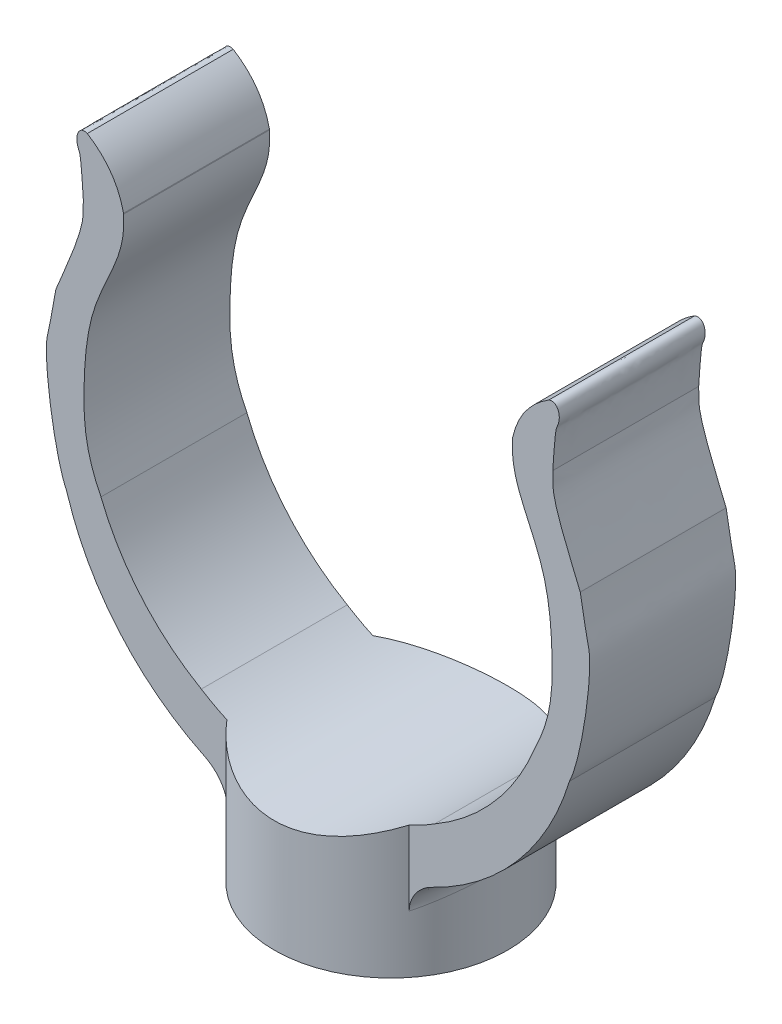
ISO-10303-21;
HEADER;
FILE_DESCRIPTION(('STEP AP214'),'2;1');
FILE_NAME('part.step','',(''),(''),'','','');
FILE_SCHEMA(('AUTOMOTIVE_DESIGN { 1 0 10303 214 1 1 1 1 }'));
ENDSEC;
DATA;
#1=APPLICATION_CONTEXT('core data for automotive mechanical design processes');
#2=APPLICATION_PROTOCOL_DEFINITION('international standard','automotive_design',2000,#1);
#3=PRODUCT_CONTEXT('',#1,'mechanical');
#4=PRODUCT('Part','Part','',(#3));
#5=PRODUCT_RELATED_PRODUCT_CATEGORY('part','',(#4));
#6=PRODUCT_DEFINITION_FORMATION('','',#4);
#7=PRODUCT_DEFINITION_CONTEXT('part definition',#1,'design');
#8=PRODUCT_DEFINITION('design','',#6,#7);
#9=PRODUCT_DEFINITION_SHAPE('','',#8);
#10=(LENGTH_UNIT() NAMED_UNIT(*) SI_UNIT(.MILLI.,.METRE.));
#11=(NAMED_UNIT(*) PLANE_ANGLE_UNIT() SI_UNIT($,.RADIAN.));
#12=(NAMED_UNIT(*) SI_UNIT($,.STERADIAN.) SOLID_ANGLE_UNIT());
#13=UNCERTAINTY_MEASURE_WITH_UNIT(LENGTH_MEASURE(1.E-05),#10,'distance_accuracy_value','');
#14=(GEOMETRIC_REPRESENTATION_CONTEXT(3) GLOBAL_UNCERTAINTY_ASSIGNED_CONTEXT((#13)) GLOBAL_UNIT_ASSIGNED_CONTEXT((#10,
#11,#12)) REPRESENTATION_CONTEXT('',''));
#15=CARTESIAN_POINT('',(0.,0.,0.));
#16=DIRECTION('',(0.,0.,1.));
#17=DIRECTION('',(1.,0.,0.));
#18=AXIS2_PLACEMENT_3D('',#15,#16,#17);
#19=CARTESIAN_POINT('',(0.,14.5,5.));
#20=DIRECTION('',(0.,0.,-1.));
#21=DIRECTION('',(-1.,0.,0.));
#22=AXIS2_PLACEMENT_3D('',#19,#20,#21);
#23=CYLINDRICAL_SURFACE('',#22,18.);
#24=CARTESIAN_POINT('',(0.,14.5,5.));
#25=DIRECTION('',(0.,0.,1.));
#26=DIRECTION('',(1.,0.,0.));
#27=AXIS2_PLACEMENT_3D('',#24,#25,#26);
#28=CIRCLE('',#27,18.);
#29=CARTESIAN_POINT('',(7.79422863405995,-1.72498073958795,5.));
#30=VERTEX_POINT('',#29);
#31=CARTESIAN_POINT('',(17.2259023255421,9.27809526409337,5.));
#32=VERTEX_POINT('',#31);
#33=EDGE_CURVE('E547',#30,#32,#28,.T.);
#34=ORIENTED_EDGE('',*,*,#33,.F.);
#35=CARTESIAN_POINT('',(4.00065850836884,-3.04977867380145,8.9577011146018));
#36=CARTESIAN_POINT('',(3.23152912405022,-3.22510988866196,7.32724647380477));
#37=CARTESIAN_POINT('',(3.55614089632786,-4.9997540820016,7.16616089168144));
#38=CARTESIAN_POINT('',(4.20987776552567,-3.00209520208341,8.84233499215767));
#39=CARTESIAN_POINT('',(3.41101180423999,-3.19380906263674,7.24860698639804));
#40=CARTESIAN_POINT('',(3.74211356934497,-4.94677244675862,7.07386799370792));
#41=CARTESIAN_POINT('',(4.41441762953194,-2.95152043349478,8.71828266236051));
#42=CARTESIAN_POINT('',(3.58978117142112,-3.15976036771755,7.16237696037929));
#43=CARTESIAN_POINT('',(3.92392678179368,-4.89057825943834,6.97462612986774));
#44=CARTESIAN_POINT('',(4.81328792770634,-2.8457416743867,8.45366726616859));
#45=CARTESIAN_POINT('',(3.9427963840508,-3.08691965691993,6.97500516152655));
#46=CARTESIAN_POINT('',(4.27847815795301,-4.77304630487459,6.76293381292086));
#47=CARTESIAN_POINT('',(5.00762250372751,-2.79053958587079,8.31311097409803));
#48=CARTESIAN_POINT('',(4.11697550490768,-3.04820010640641,6.87407781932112));
#49=CARTESIAN_POINT('',(4.45122000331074,-4.71171065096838,6.65048877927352));
#50=CARTESIAN_POINT('',(5.57398407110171,-2.61975193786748,7.8680690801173));
#51=CARTESIAN_POINT('',(4.62810621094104,-2.92641293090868,6.5505321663));
#52=CARTESIAN_POINT('',(4.95465250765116,-4.52194659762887,6.29445526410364));
#53=CARTESIAN_POINT('',(5.92971537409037,-2.49890287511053,7.54001810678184));
#54=CARTESIAN_POINT('',(4.95922782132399,-2.83674817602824,6.30482771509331));
#55=CARTESIAN_POINT('',(5.270858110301,-4.38766986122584,6.0320144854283));
#56=CARTESIAN_POINT('',(6.62418787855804,-2.24129265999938,6.79295766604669));
#57=CARTESIAN_POINT('',(5.61643803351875,-2.63899105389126,5.72858930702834));
#58=CARTESIAN_POINT('',(5.88816700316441,-4.10143628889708,5.43436613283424));
#59=CARTESIAN_POINT('',(6.95770103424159,-2.10414614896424,6.36814103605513));
#60=CARTESIAN_POINT('',(5.9405807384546,-2.52990667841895,5.39270189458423));
#61=CARTESIAN_POINT('',(6.18462314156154,-3.94905127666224,5.09451282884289));
#62=CARTESIAN_POINT('',(7.55775972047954,-1.83976678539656,5.45887335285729));
#63=CARTESIAN_POINT('',(6.53045673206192,-2.31435240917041,4.65677251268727));
#64=CARTESIAN_POINT('',(6.71800864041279,-3.65529642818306,4.36709868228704));
#65=CARTESIAN_POINT('',(7.82423203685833,-1.71254487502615,4.97435795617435));
#66=CARTESIAN_POINT('',(6.79808171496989,-2.20754431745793,4.25695352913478));
#67=CARTESIAN_POINT('',(6.95487292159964,-3.51393874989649,3.97948636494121));
#68=CARTESIAN_POINT('',(8.16977982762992,-1.53969624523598,4.20516400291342));
#69=CARTESIAN_POINT('',(7.1481845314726,-2.05998540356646,3.61078313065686));
#70=CARTESIAN_POINT('',(7.26202651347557,-3.32188471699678,3.36413120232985));
#71=CARTESIAN_POINT('',(8.27686919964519,-1.48453471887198,3.93826296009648));
#72=CARTESIAN_POINT('',(7.25704128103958,-2.01257291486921,3.38578702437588));
#73=CARTESIAN_POINT('',(7.35721706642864,-3.26059413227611,3.15061036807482));
#74=CARTESIAN_POINT('',(8.47009395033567,-1.38299146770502,3.3933214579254));
#75=CARTESIAN_POINT('',(7.45394376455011,-1.92484183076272,2.92402117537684));
#76=CARTESIAN_POINT('',(7.528972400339,-3.14776829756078,2.71465716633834));
#77=CARTESIAN_POINT('',(8.55624044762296,-1.33660508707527,3.11528700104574));
#78=CARTESIAN_POINT('',(7.54227475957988,-1.88441236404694,2.68703370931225));
#79=CARTESIAN_POINT('',(7.6055470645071,-3.09622787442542,2.49222960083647));
#80=CARTESIAN_POINT('',(8.70629174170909,-1.25461176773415,2.55083310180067));
#81=CARTESIAN_POINT('',(7.69632329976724,-1.81271783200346,2.20415802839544));
#82=CARTESIAN_POINT('',(7.73892599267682,-3.00512418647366,2.04066648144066));
#83=CARTESIAN_POINT('',(8.77025628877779,-1.21897590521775,2.26443847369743));
#84=CARTESIAN_POINT('',(7.76233717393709,-1.78132591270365,1.95798970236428));
#85=CARTESIAN_POINT('',(7.79578336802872,-2.96552878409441,1.81155077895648));
#86=CARTESIAN_POINT('',(8.87527428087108,-1.15992227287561,1.68512799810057));
#87=CARTESIAN_POINT('',(7.87072523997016,-1.72924141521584,1.45899607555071));
#88=CARTESIAN_POINT('',(7.88913269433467,-2.89991363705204,1.34810239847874));
#89=CARTESIAN_POINT('',(8.91634388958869,-1.13649588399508,1.39221690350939));
#90=CARTESIAN_POINT('',(7.91329506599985,-1.70845783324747,1.20579574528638));
#91=CARTESIAN_POINT('',(7.92563901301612,-2.87388431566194,1.11377352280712));
#92=CARTESIAN_POINT('',(8.96626253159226,-1.10790390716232,0.889918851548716));
#93=CARTESIAN_POINT('',(7.96500795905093,-1.68309280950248,0.771147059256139));
#94=CARTESIAN_POINT('',(7.97001113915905,-2.84211545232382,0.711935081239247));
#95=CARTESIAN_POINT('',(8.98105008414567,-1.09938587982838,0.681467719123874));
#96=CARTESIAN_POINT('',(7.98034923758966,-1.67552016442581,0.59055599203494));
#97=CARTESIAN_POINT('',(7.98315563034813,-2.83265097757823,0.54517417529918));
#98=CARTESIAN_POINT('',(8.99883774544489,-1.089131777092,0.263717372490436));
#99=CARTESIAN_POINT('',(7.99879040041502,-1.66640955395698,0.228629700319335));
#100=CARTESIAN_POINT('',(7.99896688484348,-2.82125753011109,0.210973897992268));
#101=CARTESIAN_POINT('',(9.00183702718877,-1.08739617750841,0.0544180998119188));
#102=CARTESIAN_POINT('',(8.0019055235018,-1.66486406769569,0.0471371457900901));
#103=CARTESIAN_POINT('',(8.0016329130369,-2.81932908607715,0.0435344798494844));
#104=CARTESIAN_POINT('',(8.99527180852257,-1.09118758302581,-0.41671761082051));
#105=CARTESIAN_POINT('',(7.99509523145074,-1.66823525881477,-0.361175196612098));
#106=CARTESIAN_POINT('',(7.99579716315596,-2.82354175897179,-0.333374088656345));
#107=CARTESIAN_POINT('',(8.98234672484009,-1.09865731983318,-0.6784868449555));
#108=CARTESIAN_POINT('',(7.98167124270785,-1.6748857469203,-0.588145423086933));
#109=CARTESIAN_POINT('',(7.98430819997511,-2.83184146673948,-0.542789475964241));
#110=CARTESIAN_POINT('',(8.93811749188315,-1.12404215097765,-1.19957436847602));
#111=CARTESIAN_POINT('',(7.93585321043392,-1.6974104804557,-1.03913828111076));
#112=CARTESIAN_POINT('',(7.94499332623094,-2.86004683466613,-0.959659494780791));
#113=CARTESIAN_POINT('',(8.90680437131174,-1.14196234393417,-1.45889139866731));
#114=CARTESIAN_POINT('',(7.90338775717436,-1.71331961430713,-1.26345997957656));
#115=CARTESIAN_POINT('',(7.91715944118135,-2.87995815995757,-1.16711311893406));
#116=CARTESIAN_POINT('',(8.82615379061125,-1.18761146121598,-1.9733800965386));
#117=CARTESIAN_POINT('',(7.82004861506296,-1.75366027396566,-1.70729765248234));
#118=CARTESIAN_POINT('',(7.8454700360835,-2.93067940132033,-1.57870407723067));
#119=CARTESIAN_POINT('',(8.77678745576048,-1.21535609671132,-2.22854443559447));
#120=CARTESIAN_POINT('',(7.76903633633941,-1.77815709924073,-1.92707867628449));
#121=CARTESIAN_POINT('',(7.80158884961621,-2.96150677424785,-1.78283554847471));
#122=CARTESIAN_POINT('',(8.66062476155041,-1.27966978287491,-2.73262020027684));
#123=CARTESIAN_POINT('',(7.64948736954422,-1.8346179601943,-2.3596658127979));
#124=CARTESIAN_POINT('',(7.698333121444,-3.03296642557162,-2.18609616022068));
#125=CARTESIAN_POINT('',(8.59382068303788,-1.31624274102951,-2.98152880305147));
#126=CARTESIAN_POINT('',(7.58079493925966,-1.86665172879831,-2.57270310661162));
#127=CARTESIAN_POINT('',(7.63895171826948,-3.07360304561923,-2.38522304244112));
#128=CARTESIAN_POINT('',(8.44397271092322,-1.39674508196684,-3.4699614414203));
#129=CARTESIAN_POINT('',(7.427451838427,-1.93667579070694,-2.98881285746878));
#130=CARTESIAN_POINT('',(7.50575352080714,-3.16305009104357,-2.77596915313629));
#131=CARTESIAN_POINT('',(8.36103079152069,-1.44062803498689,-3.70953361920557));
#132=CARTESIAN_POINT('',(7.34272524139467,-1.97470168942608,-3.19212871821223));
#133=CARTESIAN_POINT('',(7.43202737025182,-3.21180892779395,-2.96762689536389));
#134=CARTESIAN_POINT('',(8.17940114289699,-1.53458285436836,-4.17967697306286));
#135=CARTESIAN_POINT('',(7.15820788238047,-2.05547210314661,-3.58893816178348));
#136=CARTESIAN_POINT('',(7.27057879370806,-3.31620317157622,-3.34374157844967));
#137=CARTESIAN_POINT('',(8.08070771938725,-1.58465695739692,-4.41024485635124));
#138=CARTESIAN_POINT('',(7.05822227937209,-2.09828890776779,-3.78255813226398));
#139=CARTESIAN_POINT('',(7.18285130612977,-3.3718410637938,-3.52819588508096));
#140=CARTESIAN_POINT('',(7.76215840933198,-1.74207538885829,-5.08672551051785));
#141=CARTESIAN_POINT('',(6.7363235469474,-2.23212959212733,-4.34897695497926));
#142=CARTESIAN_POINT('',(6.89969636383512,-3.54675043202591,-4.06938040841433));
#143=CARTESIAN_POINT('',(7.5197449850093,-1.85666562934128,-5.51770077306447));
#144=CARTESIAN_POINT('',(6.4935815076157,-2.3279697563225,-4.70379572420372));
#145=CARTESIAN_POINT('',(6.68421776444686,-3.67407292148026,-4.41416061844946));
#146=CARTESIAN_POINT('',(6.95752642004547,-2.10405631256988,-6.36704016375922));
#147=CARTESIAN_POINT('',(5.94064634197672,-2.52972161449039,-5.39146075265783));
#148=CARTESIAN_POINT('',(6.18446792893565,-3.94895145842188,-5.09363213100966));
#149=CARTESIAN_POINT('',(6.63288469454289,-2.23757635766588,-6.78119539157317));
#150=CARTESIAN_POINT('',(5.62519674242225,-2.63592566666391,-5.71900881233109));
#151=CARTESIAN_POINT('',(5.89589750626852,-4.09730706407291,-5.42495631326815));
#152=CARTESIAN_POINT('',(6.10352072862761,-2.4346561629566,-7.354156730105));
#153=CARTESIAN_POINT('',(5.12604911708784,-2.78675298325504,-6.15944926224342));
#154=CARTESIAN_POINT('',(5.42535175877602,-4.31628462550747,-5.88332538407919));
#155=CARTESIAN_POINT('',(5.92005740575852,-2.49979797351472,-7.53705341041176));
#156=CARTESIAN_POINT('',(4.95382135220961,-2.83598650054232,-6.29872576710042));
#157=CARTESIAN_POINT('',(5.26227324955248,-4.3886644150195,-6.02964272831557));
#158=CARTESIAN_POINT('',(5.53970713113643,-2.62751948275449,-7.88594515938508));
#159=CARTESIAN_POINT('',(4.6010604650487,-2.9308480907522,-6.56093312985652));
#160=CARTESIAN_POINT('',(4.92418411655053,-4.53057720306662,-6.30875612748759));
#161=CARTESIAN_POINT('',(5.34281976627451,-2.69009910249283,-8.05193970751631));
#162=CARTESIAN_POINT('',(4.42045794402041,-2.97642859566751,-6.68366013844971));
#163=CARTESIAN_POINT('',(4.74917312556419,-4.60011011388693,-6.44155176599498));
#164=CARTESIAN_POINT('',(5.13958981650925,-2.75064104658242,-8.2090447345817));
#165=CARTESIAN_POINT('',(4.2376447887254,-3.01936308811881,-6.79741345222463));
#166=CARTESIAN_POINT('',(4.56852428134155,-4.66737894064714,-6.56723578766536));
#167=(BOUNDED_SURFACE() B_SPLINE_SURFACE(3,2,((#35,#36,#37),(#38,#39,#40),(#41,#42,#43),(#44,
#45,#46),(#47,#48,#49),(#50,#51,#52),(#53,#54,#55),(#56,#57,#58),(#59,#60,#61),(#62,#63,#64),
(#65,#66,#67),(#68,#69,#70),(#71,#72,#73),(#74,#75,#76),(#77,#78,#79),(#80,#81,#82),(#83,#84,
#85),(#86,#87,#88),(#89,#90,#91),(#92,#93,#94),(#95,#96,#97),(#98,#99,#100),(#101,#102,#103),
(#104,#105,#106),(#107,#108,#109),(#110,#111,#112),(#113,#114,#115),(#116,#117,#118),(#119,#120,
#121),(#122,#123,#124),(#125,#126,#127),(#128,#129,#130),(#131,#132,#133),(#134,#135,#136),
(#137,#138,#139),(#140,#141,#142),(#143,#144,#145),(#146,#147,#148),(#149,#150,#151),(#152,#153,
#154),(#155,#156,#157),(#158,#159,#160),(#161,#162,#163),(#164,#165,#166)),.UNSPECIFIED.,.F.,
.F.,.F.) B_SPLINE_SURFACE_WITH_KNOTS((4,2,2,2,2,2,2,2,2,2,2,2,2,2,2,2,2,2,2,2,2,4),(3,3),(0.,
0.794151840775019,1.58797884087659,3.17432721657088,4.91880081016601,6.66517132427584,
7.55986684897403,8.4540863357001,9.34587805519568,10.2370393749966,10.8644638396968,
11.4919323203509,12.2777031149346,13.0638575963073,13.8512750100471,14.6390415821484,
15.4219831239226,16.2052083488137,17.7707480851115,19.4697802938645,20.3188133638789,
21.1678725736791),(0.,1.),
.UNSPECIFIED.) GEOMETRIC_REPRESENTATION_ITEM() RATIONAL_B_SPLINE_SURFACE(((1.,0.741214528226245,
1.),(1.,0.744699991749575,1.),(1.,0.748356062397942,1.),(1.,0.755907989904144,1.),(1.,
0.759803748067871,1.),(1.,0.771696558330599,1.),(1.,0.779905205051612,1.),(1.,0.796932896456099,
1.),(1.,0.805731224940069,1.),(1.,0.82224430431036,1.),(1.,0.829957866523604,1.),(1.,
0.840222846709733,1.),(1.,0.843457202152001,1.),(1.,0.849356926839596,1.),(1.,0.852022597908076,
1.),(1.,0.856701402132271,1.),(1.,0.858716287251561,1.),(1.,0.862040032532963,1.),(1.,
0.863349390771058,1.),(1.,0.864944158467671,1.),(1.,0.865417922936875,1.),(1.,0.865988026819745,
1.),(1.,0.86608433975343,1.),(1.,0.865873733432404,1.),(1.,0.865458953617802,1.),(1.,
0.864044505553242,1.),(1.,0.863044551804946,1.),(1.,0.860483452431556,1.),(1.,0.858921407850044,
1.),(1.,0.855274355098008,1.),(1.,0.853189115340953,1.),(1.,0.848558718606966,1.),(1.,
0.846016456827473,1.),(1.,0.840518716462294,1.),(1.,0.837563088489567,1.),(1.,0.828166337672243,
1.),(1.,0.821192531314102,1.),(1.,0.805732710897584,1.),(1.,0.797168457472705,1.),(1.,
0.784156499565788,1.),(1.,0.779792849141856,1.),(1.,0.771119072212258,1.),(1.,0.766808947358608,
1.),(1.,0.7625804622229,1.))) REPRESENTATION_ITEM('') SURFACE());
#168=CARTESIAN_POINT('',(4.00065850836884,-3.04977867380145,8.9577011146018));
#169=CARTESIAN_POINT('',(4.20987776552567,-3.00209520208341,8.84233499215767));
#170=CARTESIAN_POINT('',(4.41441762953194,-2.95152043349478,8.71828266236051));
#171=CARTESIAN_POINT('',(4.81328792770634,-2.8457416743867,8.45366726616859));
#172=CARTESIAN_POINT('',(5.00762250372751,-2.79053958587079,8.31311097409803));
#173=CARTESIAN_POINT('',(5.57398407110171,-2.61975193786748,7.8680690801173));
#174=CARTESIAN_POINT('',(5.92971537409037,-2.49890287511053,7.54001810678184));
#175=CARTESIAN_POINT('',(6.62418787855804,-2.24129265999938,6.79295766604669));
#176=CARTESIAN_POINT('',(6.95770103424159,-2.10414614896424,6.36814103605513));
#177=CARTESIAN_POINT('',(7.55775972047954,-1.83976678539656,5.45887335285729));
#178=CARTESIAN_POINT('',(7.82423203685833,-1.71254487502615,4.97435795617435));
#179=CARTESIAN_POINT('',(8.16977982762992,-1.53969624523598,4.20516400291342));
#180=CARTESIAN_POINT('',(8.27686919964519,-1.48453471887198,3.93826296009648));
#181=CARTESIAN_POINT('',(8.47009395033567,-1.38299146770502,3.3933214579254));
#182=CARTESIAN_POINT('',(8.55624044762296,-1.33660508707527,3.11528700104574));
#183=CARTESIAN_POINT('',(8.70629174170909,-1.25461176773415,2.55083310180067));
#184=CARTESIAN_POINT('',(8.77025628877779,-1.21897590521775,2.26443847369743));
#185=CARTESIAN_POINT('',(8.87527428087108,-1.15992227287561,1.68512799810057));
#186=CARTESIAN_POINT('',(8.91634388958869,-1.13649588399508,1.39221690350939));
#187=CARTESIAN_POINT('',(8.96626253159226,-1.10790390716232,0.889918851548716));
#188=CARTESIAN_POINT('',(8.98105008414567,-1.09938587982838,0.681467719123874));
#189=CARTESIAN_POINT('',(8.99883774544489,-1.089131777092,0.263717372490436));
#190=CARTESIAN_POINT('',(9.00183702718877,-1.08739617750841,0.0544180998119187));
#191=CARTESIAN_POINT('',(8.99527180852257,-1.09118758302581,-0.41671761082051));
#192=CARTESIAN_POINT('',(8.98234672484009,-1.09865731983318,-0.6784868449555));
#193=CARTESIAN_POINT('',(8.93811749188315,-1.12404215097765,-1.19957436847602));
#194=CARTESIAN_POINT('',(8.90680437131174,-1.14196234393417,-1.45889139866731));
#195=CARTESIAN_POINT('',(8.82615379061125,-1.18761146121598,-1.9733800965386));
#196=CARTESIAN_POINT('',(8.77678745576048,-1.21535609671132,-2.22854443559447));
#197=CARTESIAN_POINT('',(8.66062476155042,-1.27966978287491,-2.73262020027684));
#198=CARTESIAN_POINT('',(8.59382068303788,-1.31624274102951,-2.98152880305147));
#199=CARTESIAN_POINT('',(8.44397271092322,-1.39674508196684,-3.4699614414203));
#200=CARTESIAN_POINT('',(8.36103079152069,-1.44062803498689,-3.70953361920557));
#201=CARTESIAN_POINT('',(8.17940114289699,-1.53458285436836,-4.17967697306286));
#202=CARTESIAN_POINT('',(8.08070771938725,-1.58465695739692,-4.41024485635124));
#203=CARTESIAN_POINT('',(7.76215840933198,-1.74207538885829,-5.08672551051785));
#204=CARTESIAN_POINT('',(7.5197449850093,-1.85666562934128,-5.51770077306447));
#205=CARTESIAN_POINT('',(6.95752642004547,-2.10405631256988,-6.36704016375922));
#206=CARTESIAN_POINT('',(6.6328846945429,-2.23757635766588,-6.78119539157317));
#207=CARTESIAN_POINT('',(6.10352072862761,-2.4346561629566,-7.354156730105));
#208=CARTESIAN_POINT('',(5.92005740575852,-2.49979797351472,-7.53705341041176));
#209=CARTESIAN_POINT('',(5.53970713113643,-2.62751948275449,-7.88594515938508));
#210=CARTESIAN_POINT('',(5.34281976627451,-2.69009910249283,-8.05193970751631));
#211=CARTESIAN_POINT('',(5.13958981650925,-2.75064104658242,-8.2090447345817));
#212=B_SPLINE_CURVE_WITH_KNOTS('',3,(#168,#169,#170,#171,#172,#173,#174,#175,#176,#177,#178,
#179,#180,#181,#182,#183,#184,#185,#186,#187,#188,#189,#190,#191,#192,#193,#194,#195,#196,#197,
#198,#199,#200,#201,#202,#203,#204,#205,#206,#207,#208,#209,#210,#211),.UNSPECIFIED.,.F.,.F.,(4,
2,2,2,2,2,2,2,2,2,2,2,2,2,2,2,2,2,2,2,2,4),(0.,0.794151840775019,1.58797884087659,
3.17432721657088,4.91880081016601,6.66517132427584,7.55986684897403,8.4540863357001,
9.34587805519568,10.2370393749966,10.8644638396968,11.4919323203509,12.2777031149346,
13.0638575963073,13.8512750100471,14.6390415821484,15.4219831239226,16.2052083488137,
17.7707480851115,19.4697802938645,20.3188133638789,21.1678725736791),.UNSPECIFIED.);
#213=CARTESIAN_POINT('',(7.79422863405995,-1.72498073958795,-5.));
#214=VERTEX_POINT('',#213);
#215=EDGE_CURVE('E432',#30,#214,#212,.T.);
#216=ORIENTED_EDGE('',*,*,#215,.T.);
#217=CARTESIAN_POINT('',(0.,14.5,-5.));
#218=DIRECTION('',(0.,0.,1.));
#219=DIRECTION('',(1.,0.,0.));
#220=AXIS2_PLACEMENT_3D('',#217,#218,#219);
#221=CIRCLE('',#220,18.);
#222=CARTESIAN_POINT('',(17.2259023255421,9.27809526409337,-5.));
#223=VERTEX_POINT('',#222);
#224=EDGE_CURVE('E276',#214,#223,#221,.T.);
#225=ORIENTED_EDGE('',*,*,#224,.T.);
#226=DIRECTION('',(0.,0.,-1.));
#227=VECTOR('',#226,1.);
#228=CARTESIAN_POINT('',(17.2259023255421,9.27809526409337,5.));
#229=LINE('',#228,#227);
#230=EDGE_CURVE('E331',#32,#223,#229,.T.);
#231=ORIENTED_EDGE('',*,*,#230,.F.);
#232=EDGE_LOOP('',(#34,#216,#225,#231));
#233=FACE_BOUND('',#232,.T.);
#234=ADVANCED_FACE('F45',(#233),#23,.T.);
#235=CARTESIAN_POINT('',(0.,16.,5.));
#236=DIRECTION('',(0.,0.,-1.));
#237=DIRECTION('',(-1.,0.,0.));
#238=AXIS2_PLACEMENT_3D('',#235,#236,#237);
#239=CYLINDRICAL_SURFACE('',#238,16.);
#240=DIRECTION('',(0.,0.,1.));
#241=VECTOR('',#240,1.);
#242=CARTESIAN_POINT('',(8.,2.14359353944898,-10.));
#243=LINE('',#242,#241);
#244=CARTESIAN_POINT('',(8.,2.14359353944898,-5.));
#245=VERTEX_POINT('',#244);
#246=CARTESIAN_POINT('',(8.,2.14359353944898,5.));
#247=VERTEX_POINT('',#246);
#248=EDGE_CURVE('E200',#245,#247,#243,.T.);
#249=ORIENTED_EDGE('',*,*,#248,.T.);
#250=CARTESIAN_POINT('',(0.,16.,5.));
#251=DIRECTION('',(0.,0.,1.));
#252=DIRECTION('',(1.,0.,0.));
#253=AXIS2_PLACEMENT_3D('',#250,#251,#252);
#254=CIRCLE('',#253,16.);
#255=CARTESIAN_POINT('',(14.8765736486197,10.1103857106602,5.));
#256=VERTEX_POINT('',#255);
#257=EDGE_CURVE('E618',#247,#256,#254,.T.);
#258=ORIENTED_EDGE('',*,*,#257,.T.);
#259=DIRECTION('',(0.,0.,-1.));
#260=VECTOR('',#259,1.);
#261=CARTESIAN_POINT('',(14.8765736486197,10.1103857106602,5.));
#262=LINE('',#261,#260);
#263=CARTESIAN_POINT('',(14.8765736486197,10.1103857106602,-5.));
#264=VERTEX_POINT('',#263);
#265=EDGE_CURVE('E225',#256,#264,#262,.T.);
#266=ORIENTED_EDGE('',*,*,#265,.T.);
#267=CARTESIAN_POINT('',(0.,16.,-5.));
#268=DIRECTION('',(0.,0.,1.));
#269=DIRECTION('',(1.,0.,0.));
#270=AXIS2_PLACEMENT_3D('',#267,#268,#269);
#271=CIRCLE('',#270,16.);
#272=EDGE_CURVE('E216',#245,#264,#271,.T.);
#273=ORIENTED_EDGE('',*,*,#272,.F.);
#274=EDGE_LOOP('',(#249,#258,#266,#273));
#275=FACE_BOUND('',#274,.T.);
#276=ADVANCED_FACE('F223',(#275),#239,.F.);
#277=CARTESIAN_POINT('',(-15.8612684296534,18.633748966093,5.));
#278=DIRECTION('',(0.,0.,1.));
#279=DIRECTION('',(1.,0.,0.));
#280=AXIS2_PLACEMENT_3D('',#277,#278,#279);
#281=PLANE('',#280);
#282=CARTESIAN_POINT('',(0.,14.8321710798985,5.));
#283=DIRECTION('',(0.,0.,1.));
#284=DIRECTION('',(1.,0.,0.));
#285=AXIS2_PLACEMENT_3D('',#282,#283,#284);
#286=CIRCLE('',#285,15.);
#287=CARTESIAN_POINT('',(6.2449979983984,1.19398938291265,5.));
#288=VERTEX_POINT('',#287);
#289=EDGE_CURVE('E206',#288,#247,#286,.T.);
#290=ORIENTED_EDGE('',*,*,#289,.F.);
#291=DIRECTION('',(0.,1.,0.));
#292=VECTOR('',#291,1.);
#293=CARTESIAN_POINT('',(6.2449979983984,2.14359353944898,5.));
#294=LINE('',#293,#292);
#295=CARTESIAN_POINT('',(6.2449979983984,-3.91364982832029,5.));
#296=VERTEX_POINT('',#295);
#297=EDGE_CURVE('E233',#288,#296,#294,.F.);
#298=ORIENTED_EDGE('',*,*,#297,.T.);
#299=CARTESIAN_POINT('',(6.2449979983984,-3.91364982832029,5.));
#300=CARTESIAN_POINT('',(6.24502755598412,-3.79599860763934,5.));
#301=CARTESIAN_POINT('',(6.25722605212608,-3.67901953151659,5.));
#302=CARTESIAN_POINT('',(6.30211563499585,-3.45001066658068,5.));
#303=CARTESIAN_POINT('',(6.33462995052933,-3.33794701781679,5.));
#304=CARTESIAN_POINT('',(6.42528500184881,-3.09670846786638,5.));
#305=CARTESIAN_POINT('',(6.48744910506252,-2.96907966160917,5.));
#306=CARTESIAN_POINT('',(6.63180877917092,-2.72518804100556,5.));
#307=CARTESIAN_POINT('',(6.71408629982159,-2.60897452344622,5.));
#308=CARTESIAN_POINT('',(6.89610513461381,-2.38867236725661,5.));
#309=CARTESIAN_POINT('',(6.99605973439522,-2.28476115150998,5.));
#310=CARTESIAN_POINT('',(7.20975353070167,-2.09271684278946,5.));
#311=CARTESIAN_POINT('',(7.32346013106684,-2.00454762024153,5.));
#312=CARTESIAN_POINT('',(7.49905264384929,-1.88774899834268,5.));
#313=CARTESIAN_POINT('',(7.55650563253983,-1.85230935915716,5.));
#314=CARTESIAN_POINT('',(7.67369624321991,-1.7855293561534,5.));
#315=CARTESIAN_POINT('',(7.73343236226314,-1.75418635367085,5.));
#316=CARTESIAN_POINT('',(7.79422863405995,-1.72498073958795,5.));
#317=B_SPLINE_CURVE_WITH_KNOTS('',3,(#299,#300,#301,#302,#303,#304,#305,#306,#307,#308,#309,
#310,#311,#312,#313,#314,#315,#316),.UNSPECIFIED.,.F.,.F.,(4,2,2,2,2,2,2,2,4),(0.,
0.351352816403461,0.699690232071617,1.12342057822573,1.54890701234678,1.97992924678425,
2.40994915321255,2.61232349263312,2.81456683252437),.UNSPECIFIED.);
#318=EDGE_CURVE('E445',#296,#30,#317,.T.);
#319=ORIENTED_EDGE('',*,*,#318,.T.);
#320=ORIENTED_EDGE('',*,*,#33,.T.);
#321=CARTESIAN_POINT('',(17.970441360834,20.8840512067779,5.));
#322=CARTESIAN_POINT('',(18.2898828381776,18.9276915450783,5.));
#323=CARTESIAN_POINT('',(18.5360271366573,18.0864635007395,5.));
#324=CARTESIAN_POINT('',(18.769092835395,15.9910245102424,5.));
#325=CARTESIAN_POINT('',(18.004725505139,10.8515422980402,5.));
#326=CARTESIAN_POINT('',(17.2259023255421,9.27809526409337,5.));
#327=B_SPLINE_CURVE_WITH_KNOTS('',3,(#321,#322,#323,#324,#325,#326),.UNSPECIFIED.,.F.,.F.,(4,1,
1,4),(0.,0.210543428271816,0.310543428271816,1.),.UNSPECIFIED.);
#328=CARTESIAN_POINT('',(17.970441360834,20.8840512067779,5.));
#329=VERTEX_POINT('',#328);
#330=EDGE_CURVE('E550',#329,#32,#327,.T.);
#331=ORIENTED_EDGE('',*,*,#330,.F.);
#332=CARTESIAN_POINT('',(17.970441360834,20.8840512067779,5.));
#333=CARTESIAN_POINT('',(17.9681546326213,20.8980558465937,5.));
#334=CARTESIAN_POINT('',(15.7781164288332,26.0105616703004,5.));
#335=CARTESIAN_POINT('',(16.1480617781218,26.2389641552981,5.));
#336=CARTESIAN_POINT('',(16.0882449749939,27.1531659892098,5.));
#337=B_SPLINE_CURVE_WITH_KNOTS('',3,(#332,#333,#334,#335,#336),.UNSPECIFIED.,.F.,.F.,(4,1,4),
(0.213455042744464,0.458677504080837,1.),.UNSPECIFIED.);
#338=CARTESIAN_POINT('',(16.0882449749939,27.1531659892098,5.));
#339=VERTEX_POINT('',#338);
#340=EDGE_CURVE('E551',#329,#339,#337,.T.);
#341=ORIENTED_EDGE('',*,*,#340,.T.);
#342=CARTESIAN_POINT('',(16.0882449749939,27.1531659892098,5.));
#343=CARTESIAN_POINT('',(16.0913450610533,27.1755621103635,5.));
#344=CARTESIAN_POINT('',(16.2279003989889,29.5982872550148,5.));
#345=CARTESIAN_POINT('',(16.4458005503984,30.0322101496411,5.));
#346=CARTESIAN_POINT('',(16.6677733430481,30.7115798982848,5.));
#347=CARTESIAN_POINT('',(16.2761585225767,31.3924745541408,5.));
#348=CARTESIAN_POINT('',(15.8155439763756,31.2084671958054,5.));
#349=B_SPLINE_CURVE_WITH_KNOTS('',3,(#342,#343,#344,#345,#346,#347,#348),.UNSPECIFIED.,.F.,.F.,
(4,1,1,1,4),(0.,0.319811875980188,0.380234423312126,0.604225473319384,1.),.UNSPECIFIED.);
#350=CARTESIAN_POINT('',(15.8155439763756,31.2084671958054,5.));
#351=VERTEX_POINT('',#350);
#352=EDGE_CURVE('E563',#339,#351,#349,.T.);
#353=ORIENTED_EDGE('',*,*,#352,.T.);
#354=CARTESIAN_POINT('',(13.33160117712,27.7195485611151,5.));
#355=CARTESIAN_POINT('',(13.8279521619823,29.9759913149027,5.));
#356=CARTESIAN_POINT('',(15.8155439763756,31.2084671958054,5.));
#357=B_SPLINE_CURVE_WITH_KNOTS('',2,(#354,#355,#356),.UNSPECIFIED.,.F.,.F.,(3,3),(0.,1.),.UNSPECIFIED.);
#358=CARTESIAN_POINT('',(13.33160117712,27.7195485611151,5.));
#359=VERTEX_POINT('',#358);
#360=EDGE_CURVE('E585',#359,#351,#357,.T.);
#361=ORIENTED_EDGE('',*,*,#360,.F.);
#362=DIRECTION('',(0.190808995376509,0.981627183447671,0.));
#363=VECTOR('',#362,1.);
#364=CARTESIAN_POINT('',(13.3220607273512,27.6704672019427,5.));
#365=LINE('',#364,#363);
#366=CARTESIAN_POINT('',(13.3220607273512,27.6704672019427,5.));
#367=VERTEX_POINT('',#366);
#368=EDGE_CURVE('E591',#367,#359,#365,.T.);
#369=ORIENTED_EDGE('',*,*,#368,.F.);
#370=CARTESIAN_POINT('',(13.3220607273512,27.6704672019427,5.));
#371=CARTESIAN_POINT('',(13.2260521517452,26.1387293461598,5.));
#372=CARTESIAN_POINT('',(14.0074078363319,24.0892697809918,5.));
#373=CARTESIAN_POINT('',(15.7868482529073,20.4749339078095,5.));
#374=CARTESIAN_POINT('',(16.1850994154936,15.2266058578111,5.));
#375=CARTESIAN_POINT('',(15.9509866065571,12.2425060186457,5.));
#376=CARTESIAN_POINT('',(14.8765736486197,10.1103857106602,5.));
#377=B_SPLINE_CURVE_WITH_KNOTS('',3,(#370,#371,#372,#373,#374,#375,#376),.UNSPECIFIED.,.F.,.F.,
(4,1,1,1,4),(0.,0.203211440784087,0.376639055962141,0.640999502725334,1.),.UNSPECIFIED.);
#378=EDGE_CURVE('E597',#367,#256,#377,.T.);
#379=ORIENTED_EDGE('',*,*,#378,.T.);
#380=ORIENTED_EDGE('',*,*,#257,.F.);
#381=EDGE_LOOP('',(#290,#298,#319,#320,#331,#341,#353,#361,#369,#379,#380));
#382=FACE_BOUND('',#381,.T.);
#383=ADVANCED_FACE('F382',(#382),#281,.T.);
#384=CARTESIAN_POINT('',(-15.8612684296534,18.633748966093,-5.));
#385=DIRECTION('',(0.,0.,1.));
#386=DIRECTION('',(1.,0.,0.));
#387=AXIS2_PLACEMENT_3D('',#384,#385,#386);
#388=PLANE('',#387);
#389=DIRECTION('',(0.,1.,0.));
#390=VECTOR('',#389,1.);
#391=CARTESIAN_POINT('',(6.2449979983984,2.14359353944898,-5.));
#392=LINE('',#391,#390);
#393=CARTESIAN_POINT('',(6.2449979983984,1.19398938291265,-5.));
#394=VERTEX_POINT('',#393);
#395=CARTESIAN_POINT('',(6.2449979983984,-3.91364982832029,-5.));
#396=VERTEX_POINT('',#395);
#397=EDGE_CURVE('E219',#394,#396,#392,.F.);
#398=ORIENTED_EDGE('',*,*,#397,.F.);
#399=CARTESIAN_POINT('',(0.,14.8321710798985,-5.));
#400=DIRECTION('',(0.,0.,1.));
#401=DIRECTION('',(1.,0.,0.));
#402=AXIS2_PLACEMENT_3D('',#399,#400,#401);
#403=CIRCLE('',#402,15.);
#404=EDGE_CURVE('E203',#394,#245,#403,.T.);
#405=ORIENTED_EDGE('',*,*,#404,.T.);
#406=ORIENTED_EDGE('',*,*,#272,.T.);
#407=CARTESIAN_POINT('',(13.3220607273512,27.6704672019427,-5.));
#408=CARTESIAN_POINT('',(13.2260521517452,26.1387293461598,-5.));
#409=CARTESIAN_POINT('',(14.0074078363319,24.0892697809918,-5.));
#410=CARTESIAN_POINT('',(15.7868482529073,20.4749339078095,-5.));
#411=CARTESIAN_POINT('',(16.1850994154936,15.2266058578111,-5.));
#412=CARTESIAN_POINT('',(15.9509866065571,12.2425060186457,-5.));
#413=CARTESIAN_POINT('',(14.8765736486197,10.1103857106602,-5.));
#414=B_SPLINE_CURVE_WITH_KNOTS('',3,(#407,#408,#409,#410,#411,#412,#413),.UNSPECIFIED.,.F.,.F.,
(4,1,1,1,4),(0.,0.203211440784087,0.376639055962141,0.640999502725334,1.),.UNSPECIFIED.);
#415=CARTESIAN_POINT('',(13.3220607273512,27.6704672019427,-5.));
#416=VERTEX_POINT('',#415);
#417=EDGE_CURVE('E231',#416,#264,#414,.T.);
#418=ORIENTED_EDGE('',*,*,#417,.F.);
#419=DIRECTION('',(0.190808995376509,0.981627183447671,0.));
#420=VECTOR('',#419,1.);
#421=CARTESIAN_POINT('',(13.3220607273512,27.6704672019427,-5.));
#422=LINE('',#421,#420);
#423=CARTESIAN_POINT('',(13.33160117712,27.7195485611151,-5.));
#424=VERTEX_POINT('',#423);
#425=EDGE_CURVE('E242',#416,#424,#422,.T.);
#426=ORIENTED_EDGE('',*,*,#425,.T.);
#427=CARTESIAN_POINT('',(13.33160117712,27.7195485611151,-5.));
#428=CARTESIAN_POINT('',(13.8279521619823,29.9759913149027,-5.));
#429=CARTESIAN_POINT('',(15.8155439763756,31.2084671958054,-5.));
#430=B_SPLINE_CURVE_WITH_KNOTS('',2,(#427,#428,#429),.UNSPECIFIED.,.F.,.F.,(3,3),(0.,1.),.UNSPECIFIED.);
#431=CARTESIAN_POINT('',(15.8155439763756,31.2084671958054,-5.));
#432=VERTEX_POINT('',#431);
#433=EDGE_CURVE('E248',#424,#432,#430,.T.);
#434=ORIENTED_EDGE('',*,*,#433,.T.);
#435=CARTESIAN_POINT('',(16.0882449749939,27.1531659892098,-5.));
#436=CARTESIAN_POINT('',(16.0913450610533,27.1755621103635,-5.));
#437=CARTESIAN_POINT('',(16.2279003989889,29.5982872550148,-5.));
#438=CARTESIAN_POINT('',(16.4458005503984,30.0322101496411,-5.));
#439=CARTESIAN_POINT('',(16.6677733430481,30.7115798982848,-5.));
#440=CARTESIAN_POINT('',(16.2761585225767,31.3924745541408,-5.));
#441=CARTESIAN_POINT('',(15.8155439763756,31.2084671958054,-5.));
#442=B_SPLINE_CURVE_WITH_KNOTS('',3,(#435,#436,#437,#438,#439,#440,#441),.UNSPECIFIED.,.F.,.F.,
(4,1,1,1,4),(0.,0.319811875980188,0.380234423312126,0.604225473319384,1.),.UNSPECIFIED.);
#443=CARTESIAN_POINT('',(16.0882449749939,27.1531659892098,-5.));
#444=VERTEX_POINT('',#443);
#445=EDGE_CURVE('E253',#444,#432,#442,.T.);
#446=ORIENTED_EDGE('',*,*,#445,.F.);
#447=CARTESIAN_POINT('',(17.970441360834,20.8840512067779,-5.));
#448=CARTESIAN_POINT('',(17.9681546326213,20.8980558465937,-5.));
#449=CARTESIAN_POINT('',(15.7781164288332,26.0105616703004,-5.));
#450=CARTESIAN_POINT('',(16.1480617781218,26.2389641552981,-5.));
#451=CARTESIAN_POINT('',(16.0882449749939,27.1531659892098,-5.));
#452=B_SPLINE_CURVE_WITH_KNOTS('',3,(#447,#448,#449,#450,#451),.UNSPECIFIED.,.F.,.F.,(4,1,4),
(0.213455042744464,0.458677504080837,1.),.UNSPECIFIED.);
#453=CARTESIAN_POINT('',(17.970441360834,20.8840512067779,-5.));
#454=VERTEX_POINT('',#453);
#455=EDGE_CURVE('E261',#454,#444,#452,.T.);
#456=ORIENTED_EDGE('',*,*,#455,.F.);
#457=CARTESIAN_POINT('',(17.970441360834,20.8840512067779,-5.));
#458=CARTESIAN_POINT('',(18.2898828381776,18.9276915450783,-5.));
#459=CARTESIAN_POINT('',(18.5360271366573,18.0864635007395,-5.));
#460=CARTESIAN_POINT('',(18.769092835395,15.9910245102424,-5.));
#461=CARTESIAN_POINT('',(18.004725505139,10.8515422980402,-5.));
#462=CARTESIAN_POINT('',(17.2259023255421,9.27809526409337,-5.));
#463=B_SPLINE_CURVE_WITH_KNOTS('',3,(#457,#458,#459,#460,#461,#462),.UNSPECIFIED.,.F.,.F.,(4,1,
1,4),(0.,0.210543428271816,0.310543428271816,1.),.UNSPECIFIED.);
#464=EDGE_CURVE('E268',#454,#223,#463,.T.);
#465=ORIENTED_EDGE('',*,*,#464,.T.);
#466=ORIENTED_EDGE('',*,*,#224,.F.);
#467=CARTESIAN_POINT('',(7.79422863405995,-1.72498073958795,-5.));
#468=CARTESIAN_POINT('',(7.7177892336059,-1.76171685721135,-5.));
#469=CARTESIAN_POINT('',(7.64304053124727,-1.80180336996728,-5.));
#470=CARTESIAN_POINT('',(7.49730769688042,-1.88831577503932,-5.));
#471=CARTESIAN_POINT('',(7.42632344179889,-1.93474145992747,-5.));
#472=CARTESIAN_POINT('',(7.21879951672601,-2.08355219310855,-5.));
#473=CARTESIAN_POINT('',(7.08856856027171,-2.19504454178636,-5.));
#474=CARTESIAN_POINT('',(6.91104024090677,-2.3760378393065,-5.));
#475=CARTESIAN_POINT('',(6.85550084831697,-2.43769599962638,-5.));
#476=CARTESIAN_POINT('',(6.75001276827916,-2.56561710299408,-5.));
#477=CARTESIAN_POINT('',(6.70006427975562,-2.63188020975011,-5.));
#478=CARTESIAN_POINT('',(6.55978698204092,-2.83688475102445,-5.));
#479=CARTESIAN_POINT('',(6.47863363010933,-2.98223692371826,-5.));
#480=CARTESIAN_POINT('',(6.36957023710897,-3.23730620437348,-5.));
#481=CARTESIAN_POINT('',(6.33292896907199,-3.34334787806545,-5.));
#482=CARTESIAN_POINT('',(6.27746146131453,-3.55981306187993,-5.));
#483=CARTESIAN_POINT('',(6.25856303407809,-3.67021689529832,-5.));
#484=CARTESIAN_POINT('',(6.24671413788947,-3.82535024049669,-5.));
#485=CARTESIAN_POINT('',(6.24498689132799,-3.8694989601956,-5.));
#486=CARTESIAN_POINT('',(6.2449979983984,-3.91364982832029,-5.));
#487=B_SPLINE_CURVE_WITH_KNOTS('',3,(#467,#468,#469,#470,#471,#472,#473,#474,#475,#476,#477,
#478,#479,#480,#481,#482,#483,#484,#485,#486),.UNSPECIFIED.,.F.,.F.,(4,2,2,2,2,2,2,2,2,4),(0.,
0.254204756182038,0.50840119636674,1.0196904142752,1.26838454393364,1.517087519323,
2.01284325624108,2.34829039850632,2.68236676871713,2.81480424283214),.UNSPECIFIED.);
#488=EDGE_CURVE('E454',#214,#396,#487,.T.);
#489=ORIENTED_EDGE('',*,*,#488,.T.);
#490=EDGE_LOOP('',(#398,#405,#406,#418,#426,#434,#446,#456,#465,#466,#489));
#491=FACE_BOUND('',#490,.T.);
#492=ADVANCED_FACE('F214',(#491),#388,.F.);
#493=DIRECTION('',(0.,0.,-1.));
#494=VECTOR('',#493,1.);
#495=SURFACE_OF_LINEAR_EXTRUSION('',#327,#494);
#496=ORIENTED_EDGE('',*,*,#464,.F.);
#497=DIRECTION('',(0.,0.,-1.));
#498=VECTOR('',#497,1.);
#499=CARTESIAN_POINT('',(17.970441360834,20.8840512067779,5.));
#500=LINE('',#499,#498);
#501=EDGE_CURVE('E334',#329,#454,#500,.T.);
#502=ORIENTED_EDGE('',*,*,#501,.F.);
#503=ORIENTED_EDGE('',*,*,#330,.T.);
#504=ORIENTED_EDGE('',*,*,#230,.T.);
#505=EDGE_LOOP('',(#496,#502,#503,#504));
#506=FACE_BOUND('',#505,.T.);
#507=ADVANCED_FACE('F420',(#506),#495,.T.);
#508=DIRECTION('',(0.,0.,-1.));
#509=VECTOR('',#508,1.);
#510=SURFACE_OF_LINEAR_EXTRUSION('',#337,#509);
#511=ORIENTED_EDGE('',*,*,#455,.T.);
#512=DIRECTION('',(0.,0.,-1.));
#513=VECTOR('',#512,1.);
#514=CARTESIAN_POINT('',(16.0882449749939,27.1531659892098,5.));
#515=LINE('',#514,#513);
#516=EDGE_CURVE('E336',#339,#444,#515,.T.);
#517=ORIENTED_EDGE('',*,*,#516,.F.);
#518=ORIENTED_EDGE('',*,*,#340,.F.);
#519=ORIENTED_EDGE('',*,*,#501,.T.);
#520=EDGE_LOOP('',(#511,#517,#518,#519));
#521=FACE_BOUND('',#520,.T.);
#522=ADVANCED_FACE('F571',(#521),#510,.F.);
#523=DIRECTION('',(0.,0.,-1.));
#524=VECTOR('',#523,1.);
#525=SURFACE_OF_LINEAR_EXTRUSION('',#349,#524);
#526=ORIENTED_EDGE('',*,*,#445,.T.);
#527=DIRECTION('',(0.,0.,-1.));
#528=VECTOR('',#527,1.);
#529=CARTESIAN_POINT('',(15.8155439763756,31.2084671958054,5.));
#530=LINE('',#529,#528);
#531=EDGE_CURVE('E339',#351,#432,#530,.T.);
#532=ORIENTED_EDGE('',*,*,#531,.F.);
#533=ORIENTED_EDGE('',*,*,#352,.F.);
#534=ORIENTED_EDGE('',*,*,#516,.T.);
#535=EDGE_LOOP('',(#526,#532,#533,#534));
#536=FACE_BOUND('',#535,.T.);
#537=ADVANCED_FACE('F574',(#536),#525,.F.);
#538=DIRECTION('',(0.,0.,-1.));
#539=VECTOR('',#538,1.);
#540=SURFACE_OF_LINEAR_EXTRUSION('',#357,#539);
#541=ORIENTED_EDGE('',*,*,#433,.F.);
#542=DIRECTION('',(0.,0.,-1.));
#543=VECTOR('',#542,1.);
#544=CARTESIAN_POINT('',(13.33160117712,27.7195485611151,5.));
#545=LINE('',#544,#543);
#546=EDGE_CURVE('E341',#359,#424,#545,.T.);
#547=ORIENTED_EDGE('',*,*,#546,.F.);
#548=ORIENTED_EDGE('',*,*,#360,.T.);
#549=ORIENTED_EDGE('',*,*,#531,.T.);
#550=EDGE_LOOP('',(#541,#547,#548,#549));
#551=FACE_BOUND('',#550,.T.);
#552=ADVANCED_FACE('F578',(#551),#540,.T.);
#553=CARTESIAN_POINT('',(13.3220607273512,27.6704672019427,5.));
#554=DIRECTION('',(-0.981627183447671,0.190808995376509,0.));
#555=DIRECTION('',(-0.190808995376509,-0.981627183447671,0.));
#556=AXIS2_PLACEMENT_3D('',#553,#554,#555);
#557=PLANE('',#556);
#558=ORIENTED_EDGE('',*,*,#425,.F.);
#559=DIRECTION('',(0.,0.,-1.));
#560=VECTOR('',#559,1.);
#561=CARTESIAN_POINT('',(13.3220607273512,27.6704672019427,5.));
#562=LINE('',#561,#560);
#563=EDGE_CURVE('E343',#367,#416,#562,.T.);
#564=ORIENTED_EDGE('',*,*,#563,.F.);
#565=ORIENTED_EDGE('',*,*,#368,.T.);
#566=ORIENTED_EDGE('',*,*,#546,.T.);
#567=EDGE_LOOP('',(#558,#564,#565,#566));
#568=FACE_BOUND('',#567,.T.);
#569=ADVANCED_FACE('F582',(#568),#557,.T.);
#570=DIRECTION('',(0.,0.,-1.));
#571=VECTOR('',#570,1.);
#572=SURFACE_OF_LINEAR_EXTRUSION('',#377,#571);
#573=ORIENTED_EDGE('',*,*,#417,.T.);
#574=ORIENTED_EDGE('',*,*,#265,.F.);
#575=ORIENTED_EDGE('',*,*,#378,.F.);
#576=ORIENTED_EDGE('',*,*,#563,.T.);
#577=EDGE_LOOP('',(#573,#574,#575,#576));
#578=FACE_BOUND('',#577,.T.);
#579=ADVANCED_FACE('F379',(#578),#572,.F.);
#580=CARTESIAN_POINT('',(0.,2.14359353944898,0.));
#581=DIRECTION('',(0.,1.,0.));
#582=DIRECTION('',(-1.,0.,0.));
#583=AXIS2_PLACEMENT_3D('',#580,#581,#582);
#584=CYLINDRICAL_SURFACE('',#583,8.);
#585=CARTESIAN_POINT('',(4.56852428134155,-4.66737894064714,-6.56723578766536));
#586=CARTESIAN_POINT('',(4.74917312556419,-4.60011011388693,-6.44155176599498));
#587=CARTESIAN_POINT('',(4.92418411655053,-4.53057720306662,-6.30875612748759));
#588=CARTESIAN_POINT('',(5.26227324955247,-4.3886644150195,-6.02964272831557));
#589=CARTESIAN_POINT('',(5.42535175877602,-4.31628462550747,-5.88332538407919));
#590=CARTESIAN_POINT('',(5.89589750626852,-4.09730706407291,-5.42495631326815));
#591=CARTESIAN_POINT('',(6.18446792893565,-3.94895145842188,-5.09363213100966));
#592=CARTESIAN_POINT('',(6.68421776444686,-3.67407292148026,-4.41416061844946));
#593=CARTESIAN_POINT('',(6.89969636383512,-3.54675043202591,-4.06938040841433));
#594=CARTESIAN_POINT('',(7.18285130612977,-3.3718410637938,-3.52819588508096));
#595=CARTESIAN_POINT('',(7.27057879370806,-3.31620317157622,-3.34374157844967));
#596=CARTESIAN_POINT('',(7.43202737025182,-3.21180892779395,-2.96762689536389));
#597=CARTESIAN_POINT('',(7.50575352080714,-3.16305009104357,-2.77596915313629));
#598=CARTESIAN_POINT('',(7.63895171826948,-3.07360304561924,-2.38522304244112));
#599=CARTESIAN_POINT('',(7.698333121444,-3.03296642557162,-2.18609616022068));
#600=CARTESIAN_POINT('',(7.80158884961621,-2.96150677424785,-1.78283554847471));
#601=CARTESIAN_POINT('',(7.8454700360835,-2.93067940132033,-1.57870407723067));
#602=CARTESIAN_POINT('',(7.91715944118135,-2.87995815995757,-1.16711311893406));
#603=CARTESIAN_POINT('',(7.94499332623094,-2.86004683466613,-0.959659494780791));
#604=CARTESIAN_POINT('',(7.98430819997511,-2.83184146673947,-0.542789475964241));
#605=CARTESIAN_POINT('',(7.99579716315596,-2.82354175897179,-0.333374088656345));
#606=CARTESIAN_POINT('',(8.0016329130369,-2.81932908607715,0.0435344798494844));
#607=CARTESIAN_POINT('',(7.99896688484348,-2.82125753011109,0.210973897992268));
#608=CARTESIAN_POINT('',(7.98315563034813,-2.83265097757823,0.54517417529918));
#609=CARTESIAN_POINT('',(7.97001113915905,-2.84211545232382,0.711935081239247));
#610=CARTESIAN_POINT('',(7.92563901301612,-2.87388431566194,1.11377352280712));
#611=CARTESIAN_POINT('',(7.88913269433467,-2.89991363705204,1.34810239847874));
#612=CARTESIAN_POINT('',(7.79578336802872,-2.96552878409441,1.81155077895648));
#613=CARTESIAN_POINT('',(7.73892599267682,-3.00512418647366,2.04066648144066));
#614=CARTESIAN_POINT('',(7.6055470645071,-3.09622787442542,2.49222960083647));
#615=CARTESIAN_POINT('',(7.528972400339,-3.14776829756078,2.71465716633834));
#616=CARTESIAN_POINT('',(7.35721706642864,-3.26059413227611,3.15061036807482));
#617=CARTESIAN_POINT('',(7.26202651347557,-3.32188471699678,3.36413120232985));
#618=CARTESIAN_POINT('',(6.95487292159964,-3.51393874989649,3.97948636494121));
#619=CARTESIAN_POINT('',(6.71800864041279,-3.65529642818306,4.36709868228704));
#620=CARTESIAN_POINT('',(6.18462314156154,-3.94905127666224,5.09451282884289));
#621=CARTESIAN_POINT('',(5.88816700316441,-4.10143628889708,5.43436613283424));
#622=CARTESIAN_POINT('',(5.27085811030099,-4.38766986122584,6.0320144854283));
#623=CARTESIAN_POINT('',(4.95465250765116,-4.52194659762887,6.29445526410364));
#624=CARTESIAN_POINT('',(4.45122000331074,-4.71171065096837,6.65048877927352));
#625=CARTESIAN_POINT('',(4.27847815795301,-4.77304630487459,6.76293381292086));
#626=CARTESIAN_POINT('',(3.92392678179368,-4.89057825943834,6.97462612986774));
#627=CARTESIAN_POINT('',(3.74211356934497,-4.94677244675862,7.07386799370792));
#628=CARTESIAN_POINT('',(3.55614089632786,-4.9997540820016,7.16616089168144));
#629=B_SPLINE_CURVE_WITH_KNOTS('',3,(#585,#586,#587,#588,#589,#590,#591,#592,#593,#594,#595,
#596,#597,#598,#599,#600,#601,#602,#603,#604,#605,#606,#607,#608,#609,#610,#611,#612,#613,#614,
#615,#616,#617,#618,#619,#620,#621,#622,#623,#624,#625,#626,#627,#628),.UNSPECIFIED.,.F.,.F.,(4,
2,2,2,2,2,2,2,2,2,2,2,2,2,2,2,2,2,2,2,2,4),(0.,0.849059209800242,1.69809227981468,
3.39712448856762,4.96266422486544,5.7458894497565,6.52883099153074,7.31659756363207,
8.10401497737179,8.89016945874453,9.67594025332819,10.3034087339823,10.9308331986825,
11.8219945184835,12.713786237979,13.6080057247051,14.5027012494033,16.2490717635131,
17.9935453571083,19.5798937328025,20.3737207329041,21.1678725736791),.UNSPECIFIED.);
#630=EDGE_CURVE('E363',#396,#296,#629,.T.);
#631=ORIENTED_EDGE('',*,*,#630,.T.);
#632=ORIENTED_EDGE('',*,*,#297,.F.);
#633=CARTESIAN_POINT('',(-7.99999999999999,2.14359353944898,0.));
#634=CARTESIAN_POINT('',(-8.0000008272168,2.14359455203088,-0.206280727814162));
#635=CARTESIAN_POINT('',(-7.99201174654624,2.13854661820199,-0.412552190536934));
#636=CARTESIAN_POINT('',(-7.96017537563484,2.1185578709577,-0.823459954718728));
#637=CARTESIAN_POINT('',(-7.93632212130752,2.10361333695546,-1.02809561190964));
#638=CARTESIAN_POINT('',(-7.87306095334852,2.06438777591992,-1.43430299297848));
#639=CARTESIAN_POINT('',(-7.83363262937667,2.04009449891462,-1.63587033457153));
#640=CARTESIAN_POINT('',(-7.73973085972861,1.98306302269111,-2.0343271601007));
#641=CARTESIAN_POINT('',(-7.68525075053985,1.95032108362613,-2.23121453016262));
#642=CARTESIAN_POINT('',(-7.56228385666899,1.87775414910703,-2.61777402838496));
#643=CARTESIAN_POINT('',(-7.49388888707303,1.83797579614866,-2.80748425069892));
#644=CARTESIAN_POINT('',(-7.3435222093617,1.75240939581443,-3.18010557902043));
#645=CARTESIAN_POINT('',(-7.26154553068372,1.70661914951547,-3.36301416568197));
#646=CARTESIAN_POINT('',(-7.0846895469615,1.61032201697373,-3.72116109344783));
#647=CARTESIAN_POINT('',(-6.9898120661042,1.55981579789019,-3.89640051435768));
#648=CARTESIAN_POINT('',(-6.78781438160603,1.45537985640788,-4.23852477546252));
#649=CARTESIAN_POINT('',(-6.68069376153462,1.40145001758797,-4.40540933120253));
#650=CARTESIAN_POINT('',(-6.32032913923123,1.22596544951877,-4.92349422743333));
#651=CARTESIAN_POINT('',(-6.04463813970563,1.10016554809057,-5.25820159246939));
#652=CARTESIAN_POINT('',(-5.59347847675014,0.913130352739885,-5.72362528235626));
#653=CARTESIAN_POINT('',(-5.43671146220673,0.851024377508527,-5.8727421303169));
#654=CARTESIAN_POINT('',(-5.11109924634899,0.728736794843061,-6.15820501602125));
#655=CARTESIAN_POINT('',(-4.94225210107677,0.668555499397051,-6.29454899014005));
#656=CARTESIAN_POINT('',(-4.57935642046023,0.546899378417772,-6.56388302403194));
#657=CARTESIAN_POINT('',(-4.3843718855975,0.48570382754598,-6.69573942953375));
#658=CARTESIAN_POINT('',(-3.98237404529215,0.368960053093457,-6.94235290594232));
#659=CARTESIAN_POINT('',(-3.77536600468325,0.313409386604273,-7.05711738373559));
#660=CARTESIAN_POINT('',(-3.35057394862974,0.209536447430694,-7.26841855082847));
#661=CARTESIAN_POINT('',(-3.13279317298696,0.161212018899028,-7.36496067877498));
#662=CARTESIAN_POINT('',(-2.68795642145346,0.0732325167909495,-7.53869236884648));
#663=CARTESIAN_POINT('',(-2.46090159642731,0.0335763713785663,-7.61588432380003));
#664=CARTESIAN_POINT('',(-2.01763632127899,-0.033068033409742,-7.74455376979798));
#665=CARTESIAN_POINT('',(-1.80198906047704,-0.0608102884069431,-7.79758248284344));
#666=CARTESIAN_POINT('',(-1.36607301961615,-0.107101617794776,-7.88563729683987));
#667=CARTESIAN_POINT('',(-1.14580446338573,-0.125651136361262,-7.92066426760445));
#668=CARTESIAN_POINT('',(-0.702641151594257,-0.153006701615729,-7.97220359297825));
#669=CARTESIAN_POINT('',(-0.479748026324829,-0.161818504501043,-7.98872688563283));
#670=CARTESIAN_POINT('',(-0.0331964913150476,-0.169453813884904,-8.00304874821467));
#671=CARTESIAN_POINT('',(0.190461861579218,-0.168278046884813,-8.00084868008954));
#672=CARTESIAN_POINT('',(0.614471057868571,-0.156587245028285,-7.97890621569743));
#673=CARTESIAN_POINT('',(0.814941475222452,-0.14700639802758,-7.96091846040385));
#674=CARTESIAN_POINT('',(1.2134408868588,-0.120000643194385,-7.90998778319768));
#675=CARTESIAN_POINT('',(1.41146986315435,-0.102575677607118,-7.87704475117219));
#676=CARTESIAN_POINT('',(1.80372417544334,-0.0602933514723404,-7.79658046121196));
#677=CARTESIAN_POINT('',(1.99794954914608,-0.0354360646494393,-7.74905934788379));
#678=CARTESIAN_POINT('',(2.3813778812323,0.0211412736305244,-7.63994618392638));
#679=CARTESIAN_POINT('',(2.57058064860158,0.0528615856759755,-7.57835359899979));
#680=CARTESIAN_POINT('',(2.94506910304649,0.122879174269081,-7.44088782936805));
#681=CARTESIAN_POINT('',(3.1302827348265,0.161249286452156,-7.36485549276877));
#682=CARTESIAN_POINT('',(3.49352300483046,0.243475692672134,-7.19966295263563));
#683=CARTESIAN_POINT('',(3.67154724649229,0.287333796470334,-7.11049841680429));
#684=CARTESIAN_POINT('',(4.19348838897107,0.42578541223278,-6.82436502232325));
#685=CARTESIAN_POINT('',(4.52549971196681,0.52730016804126,-6.60867258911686));
#686=CARTESIAN_POINT('',(5.1845632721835,0.751907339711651,-6.10810196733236));
#687=CARTESIAN_POINT('',(5.50754077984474,0.876145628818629,-5.81837198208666));
#688=CARTESIAN_POINT('',(5.95360340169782,1.06333724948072,-5.34803157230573));
#689=CARTESIAN_POINT('',(6.0959904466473,1.1259247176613,-5.18514684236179));
#690=CARTESIAN_POINT('',(6.36737369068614,1.24987489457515,-4.84802585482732));
#691=CARTESIAN_POINT('',(6.49636768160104,1.31123740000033,-4.6737877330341));
#692=CARTESIAN_POINT('',(6.74990405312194,1.43589085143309,-4.30043007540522));
#693=CARTESIAN_POINT('',(6.87327380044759,1.49894619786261,-4.10043408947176));
#694=CARTESIAN_POINT('',(7.10248719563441,1.61962220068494,-3.68918108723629));
#695=CARTESIAN_POINT('',(7.20833872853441,1.67724529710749,-3.47792919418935));
#696=CARTESIAN_POINT('',(7.40146247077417,1.78492693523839,-3.04539119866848));
#697=CARTESIAN_POINT('',(7.48874671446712,1.834990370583,-2.82411170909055));
#698=CARTESIAN_POINT('',(7.64370915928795,1.92551463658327,-2.37288542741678));
#699=CARTESIAN_POINT('',(7.71139038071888,1.96597694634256,-2.14293997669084));
#700=CARTESIAN_POINT('',(7.82145437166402,2.03261443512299,-1.69517317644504));
#701=CARTESIAN_POINT('',(7.86544291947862,2.05968175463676,-1.47787960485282));
#702=CARTESIAN_POINT('',(7.93530677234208,2.10296812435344,-1.03932304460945));
#703=CARTESIAN_POINT('',(7.96118319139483,2.11918784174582,-0.818060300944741));
#704=CARTESIAN_POINT('',(7.99436472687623,2.14002706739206,-0.37378308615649));
#705=CARTESIAN_POINT('',(8.00168522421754,2.14465618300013,-0.150770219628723));
#706=CARTESIAN_POINT('',(7.99766461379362,2.14212098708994,0.29500878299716));
#707=CARTESIAN_POINT('',(7.9863252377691,2.13495776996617,0.517774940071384));
#708=CARTESIAN_POINT('',(7.94793800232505,2.11090149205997,0.931405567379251));
#709=CARTESIAN_POINT('',(7.92318043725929,2.09542951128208,1.12257174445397));
#710=CARTESIAN_POINT('',(7.86010987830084,2.05641087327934,1.50187997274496));
#711=CARTESIAN_POINT('',(7.82179249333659,2.03286160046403,1.69002102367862));
#712=CARTESIAN_POINT('',(7.73205060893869,1.97845023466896,2.06204037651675));
#713=CARTESIAN_POINT('',(7.68062708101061,1.94758868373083,2.24591899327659));
#714=CARTESIAN_POINT('',(7.56517167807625,1.87946220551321,2.60852435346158));
#715=CARTESIAN_POINT('',(7.50113476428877,1.84219471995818,2.78724900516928));
#716=CARTESIAN_POINT('',(7.35794410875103,1.76053223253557,3.14637080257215));
#717=CARTESIAN_POINT('',(7.27825059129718,1.71589633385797,3.32649758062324));
#718=CARTESIAN_POINT('',(7.10633908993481,1.62196524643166,3.67946985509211));
#719=CARTESIAN_POINT('',(7.01411693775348,1.57266850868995,3.85231290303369));
#720=CARTESIAN_POINT('',(6.81773611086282,1.47063232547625,4.19006493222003));
#721=CARTESIAN_POINT('',(6.7135746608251,1.41789208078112,4.35497205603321));
#722=CARTESIAN_POINT('',(6.49387939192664,1.31017050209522,4.67626027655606));
#723=CARTESIAN_POINT('',(6.37834479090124,1.25518901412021,4.83264078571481));
#724=CARTESIAN_POINT('',(6.11858240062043,1.13595763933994,5.15873689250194));
#725=CARTESIAN_POINT('',(5.97263494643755,1.07153553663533,5.32702338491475));
#726=CARTESIAN_POINT('',(5.66717190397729,0.942944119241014,5.65090431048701));
#727=CARTESIAN_POINT('',(5.50765574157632,0.87877481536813,5.80649820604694));
#728=CARTESIAN_POINT('',(5.17570667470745,0.752269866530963,6.10424347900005));
#729=CARTESIAN_POINT('',(5.00326794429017,0.689935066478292,6.24638872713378));
#730=CARTESIAN_POINT('',(4.64630001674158,0.568671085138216,6.51628490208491));
#731=CARTESIAN_POINT('',(4.46176926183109,0.509742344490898,6.64403396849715));
#732=CARTESIAN_POINT('',(4.07354485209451,0.394410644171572,6.88920293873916));
#733=CARTESIAN_POINT('',(3.86937210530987,0.338217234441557,7.00596502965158));
#734=CARTESIAN_POINT('',(3.45019516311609,0.23275910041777,7.22161153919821));
#735=CARTESIAN_POINT('',(3.23519617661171,0.183491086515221,7.32050445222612));
#736=CARTESIAN_POINT('',(2.79586603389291,0.0933318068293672,7.4992893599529));
#737=CARTESIAN_POINT('',(2.57153999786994,0.0524360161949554,7.57919162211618));
#738=CARTESIAN_POINT('',(2.11523636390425,-0.0197345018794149,7.71898236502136));
#739=CARTESIAN_POINT('',(1.88325983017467,-0.0510105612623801,7.77887361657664));
#740=CARTESIAN_POINT('',(1.43696201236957,-0.100359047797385,7.87285751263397));
#741=CARTESIAN_POINT('',(1.22316354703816,-0.119431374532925,7.90891578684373));
#742=CARTESIAN_POINT('',(0.792732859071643,-0.148419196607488,7.96358123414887));
#743=CARTESIAN_POINT('',(0.576100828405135,-0.158335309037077,7.98218958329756));
#744=CARTESIAN_POINT('',(0.141899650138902,-0.168729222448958,8.00169215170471));
#745=CARTESIAN_POINT('',(-0.0756691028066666,-0.169210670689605,8.00259321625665));
#746=CARTESIAN_POINT('',(-0.509967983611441,-0.160730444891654,7.98668535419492));
#747=CARTESIAN_POINT('',(-0.726698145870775,-0.151769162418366,7.96987716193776));
#748=CARTESIAN_POINT('',(-1.13993624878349,-0.125765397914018,7.92087442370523));
#749=CARTESIAN_POINT('',(-1.33665343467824,-0.109440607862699,7.89004465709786));
#750=CARTESIAN_POINT('',(-1.72658766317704,-0.0694166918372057,7.81398520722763));
#751=CARTESIAN_POINT('',(-1.91980350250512,-0.0457150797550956,7.76875066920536));
#752=CARTESIAN_POINT('',(-2.30138685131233,0.00851600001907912,7.66438096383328));
#753=CARTESIAN_POINT('',(-2.48975583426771,0.0390433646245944,7.60525007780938));
#754=CARTESIAN_POINT('',(-2.86070279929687,0.106277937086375,7.47362893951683));
#755=CARTESIAN_POINT('',(-3.04327852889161,0.142987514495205,7.40113356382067));
#756=CARTESIAN_POINT('',(-3.40831874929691,0.223284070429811,7.24048335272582));
#757=CARTESIAN_POINT('',(-3.59052521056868,0.267076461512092,7.15184538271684));
#758=CARTESIAN_POINT('',(-3.94680147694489,0.359553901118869,6.96157753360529));
#759=CARTESIAN_POINT('',(-4.12086828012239,0.408240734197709,6.85994291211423));
#760=CARTESIAN_POINT('',(-4.46007274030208,0.509493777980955,6.64440643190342));
#761=CARTESIAN_POINT('',(-4.62520918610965,0.562060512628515,6.53050291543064));
#762=CARTESIAN_POINT('',(-4.94589577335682,0.670012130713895,6.29111749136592));
#763=CARTESIAN_POINT('',(-5.10144513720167,0.725397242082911,6.16563464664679));
#764=CARTESIAN_POINT('',(-5.41899884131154,0.844095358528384,5.88927069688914));
#765=CARTESIAN_POINT('',(-5.57982089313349,0.907608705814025,5.73711495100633));
#766=CARTESIAN_POINT('',(-5.88822197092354,1.03518961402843,5.42012453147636));
#767=CARTESIAN_POINT('',(-6.03579980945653,1.0992572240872,5.25528872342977));
#768=CARTESIAN_POINT('',(-6.31714795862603,1.22638194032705,4.91352052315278));
#769=CARTESIAN_POINT('',(-6.45090273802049,1.28943784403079,4.7365748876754));
#770=CARTESIAN_POINT('',(-6.70365634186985,1.41275352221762,4.37153004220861));
#771=CARTESIAN_POINT('',(-6.82265601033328,1.47301345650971,4.18343147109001));
#772=CARTESIAN_POINT('',(-7.05111918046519,1.59211050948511,3.78641838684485));
#773=CARTESIAN_POINT('',(-7.1597181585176,1.65069416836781,3.5769282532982));
#774=CARTESIAN_POINT('',(-7.35859675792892,1.76067612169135,3.14754436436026));
#775=CARTESIAN_POINT('',(-7.44887326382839,1.81207319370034,2.92764884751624));
#776=CARTESIAN_POINT('',(-7.60975396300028,1.90544361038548,2.47954511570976));
#777=CARTESIAN_POINT('',(-7.68041349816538,1.94744339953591,2.2513623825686));
#778=CARTESIAN_POINT('',(-7.80129547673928,2.0202708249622,1.7880295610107));
#779=CARTESIAN_POINT('',(-7.85153144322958,2.05110585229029,1.55288419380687));
#780=CARTESIAN_POINT('',(-7.92721566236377,2.09792408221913,1.09883121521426));
#781=CARTESIAN_POINT('',(-7.95446803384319,2.11498244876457,0.880334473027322));
#782=CARTESIAN_POINT('',(-7.99086010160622,2.13781684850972,0.441221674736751));
#783=CARTESIAN_POINT('',(-7.99999911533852,2.14359245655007,0.220605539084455));
#784=CARTESIAN_POINT('',(-7.99999999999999,2.14359353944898,0.));
#785=B_SPLINE_CURVE_WITH_KNOTS('',3,(#633,#634,#635,#636,#637,#638,#639,#640,#641,#642,#643,
#644,#645,#646,#647,#648,#649,#650,#651,#652,#653,#654,#655,#656,#657,#658,#659,#660,#661,#662,
#663,#664,#665,#666,#667,#668,#669,#670,#671,#672,#673,#674,#675,#676,#677,#678,#679,#680,#681,
#682,#683,#684,#685,#686,#687,#688,#689,#690,#691,#692,#693,#694,#695,#696,#697,#698,#699,#700,
#701,#702,#703,#704,#705,#706,#707,#708,#709,#710,#711,#712,#713,#714,#715,#716,#717,#718,#719,
#720,#721,#722,#723,#724,#725,#726,#727,#728,#729,#730,#731,#732,#733,#734,#735,#736,#737,#738,
#739,#740,#741,#742,#743,#744,#745,#746,#747,#748,#749,#750,#751,#752,#753,#754,#755,#756,#757,
#758,#759,#760,#761,#762,#763,#764,#765,#766,#767,#768,#769,#770,#771,#772,#773,#774,#775,#776,
#777,#778,#779,#780,#781,#782,#783,#784),.UNSPECIFIED.,.T.,.F.,(4,2,2,2,2,2,2,2,2,2,2,2,2,2,2,2,
2,2,2,2,2,2,2,2,2,2,2,2,2,2,2,2,2,2,2,2,2,2,2,2,2,2,2,2,2,2,2,2,2,2,2,2,2,2,2,2,2,2,2,2,2,2,2,2,
2,2,2,2,2,2,2,2,2,2,2,4),(0.,0.618612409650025,1.23745751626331,1.85711629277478,
2.47704983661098,3.09301829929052,3.70921269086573,4.32532004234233,4.94144835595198,
6.2893297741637,6.96411577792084,7.63901061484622,8.36770205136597,9.09607678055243,
9.8242337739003,10.5523006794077,11.2227676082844,11.893202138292,12.5632401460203,
13.2332294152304,13.8370243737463,14.4408237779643,15.0446171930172,15.6484335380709,
16.2593380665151,16.8704445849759,18.0919304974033,19.4399210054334,20.1150149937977,
20.7902201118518,21.5191974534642,22.247845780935,22.9760203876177,23.7040827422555,
24.3731385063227,25.0421531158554,25.7106130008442,26.3790108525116,26.9584945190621,
27.5381660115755,28.1177945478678,28.6976551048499,29.3029446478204,29.9084360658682,
30.5140685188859,31.1197426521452,31.8146386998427,32.5095641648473,33.2048048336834,
33.900135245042,34.6246245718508,35.3487685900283,36.0725201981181,36.796171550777,
37.4482560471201,38.1002965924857,38.7520850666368,39.4038465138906,40.0025200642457,
40.6013955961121,41.2000868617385,41.7990081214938,42.4202632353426,43.041745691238,
43.6633122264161,44.2849291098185,44.9751514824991,45.665435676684,46.3564872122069,
47.0474992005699,47.7759050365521,48.5044346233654,49.2308875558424,49.9568586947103,
50.618404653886,51.2799755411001),.UNSPECIFIED.);
#786=CARTESIAN_POINT('',(-6.2449979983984,1.19398938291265,5.));
#787=VERTEX_POINT('',#786);
#788=EDGE_CURVE('E388',#288,#787,#785,.T.);
#789=ORIENTED_EDGE('',*,*,#788,.T.);
#790=DIRECTION('',(0.,1.,0.));
#791=VECTOR('',#790,1.);
#792=CARTESIAN_POINT('',(-6.2449979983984,2.14359353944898,5.));
#793=LINE('',#792,#791);
#794=CARTESIAN_POINT('',(-6.2449979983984,-3.91364982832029,5.));
#795=VERTEX_POINT('',#794);
#796=EDGE_CURVE('E623',#795,#787,#793,.T.);
#797=ORIENTED_EDGE('',*,*,#796,.F.);
#798=CARTESIAN_POINT('',(-4.00065850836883,-3.04977867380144,-8.9577011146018));
#799=CARTESIAN_POINT('',(-3.23152912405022,-3.22510988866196,-7.32724647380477));
#800=CARTESIAN_POINT('',(-3.55614089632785,-4.9997540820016,-7.16616089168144));
#801=CARTESIAN_POINT('',(-4.20987776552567,-3.00209520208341,-8.84233499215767));
#802=CARTESIAN_POINT('',(-3.41101180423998,-3.19380906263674,-7.24860698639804));
#803=CARTESIAN_POINT('',(-3.74211356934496,-4.94677244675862,-7.07386799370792));
#804=CARTESIAN_POINT('',(-4.41441762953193,-2.95152043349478,-8.71828266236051));
#805=CARTESIAN_POINT('',(-3.58978117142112,-3.15976036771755,-7.1623769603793));
#806=CARTESIAN_POINT('',(-3.92392678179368,-4.89057825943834,-6.97462612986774));
#807=CARTESIAN_POINT('',(-4.81328792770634,-2.84574167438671,-8.45366726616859));
#808=CARTESIAN_POINT('',(-3.9427963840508,-3.08691965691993,-6.97500516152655));
#809=CARTESIAN_POINT('',(-4.278478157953,-4.77304630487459,-6.76293381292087));
#810=CARTESIAN_POINT('',(-5.0076225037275,-2.79053958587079,-8.31311097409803));
#811=CARTESIAN_POINT('',(-4.11697550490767,-3.04820010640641,-6.87407781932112));
#812=CARTESIAN_POINT('',(-4.45122000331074,-4.71171065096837,-6.65048877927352));
#813=CARTESIAN_POINT('',(-5.5739840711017,-2.61975193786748,-7.86806908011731));
#814=CARTESIAN_POINT('',(-4.62810621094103,-2.92641293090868,-6.5505321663));
#815=CARTESIAN_POINT('',(-4.95465250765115,-4.52194659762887,-6.29445526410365));
#816=CARTESIAN_POINT('',(-5.92971537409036,-2.49890287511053,-7.54001810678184));
#817=CARTESIAN_POINT('',(-4.95922782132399,-2.83674817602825,-6.30482771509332));
#818=CARTESIAN_POINT('',(-5.27085811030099,-4.38766986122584,-6.0320144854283));
#819=CARTESIAN_POINT('',(-6.62418787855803,-2.24129265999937,-6.7929576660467));
#820=CARTESIAN_POINT('',(-5.61643803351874,-2.63899105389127,-5.72858930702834));
#821=CARTESIAN_POINT('',(-5.8881670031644,-4.10143628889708,-5.43436613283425));
#822=CARTESIAN_POINT('',(-6.95770103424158,-2.10414614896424,-6.36814103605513));
#823=CARTESIAN_POINT('',(-5.94058073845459,-2.52990667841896,-5.39270189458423));
#824=CARTESIAN_POINT('',(-6.18462314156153,-3.94905127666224,-5.0945128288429));
#825=CARTESIAN_POINT('',(-7.55775972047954,-1.83976678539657,-5.45887335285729));
#826=CARTESIAN_POINT('',(-6.53045673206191,-2.31435240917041,-4.65677251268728));
#827=CARTESIAN_POINT('',(-6.71800864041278,-3.65529642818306,-4.36709868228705));
#828=CARTESIAN_POINT('',(-7.82423203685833,-1.71254487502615,-4.97435795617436));
#829=CARTESIAN_POINT('',(-6.79808171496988,-2.20754431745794,-4.25695352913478));
#830=CARTESIAN_POINT('',(-6.95487292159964,-3.51393874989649,-3.97948636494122));
#831=CARTESIAN_POINT('',(-8.16977982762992,-1.53969624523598,-4.20516400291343));
#832=CARTESIAN_POINT('',(-7.1481845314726,-2.05998540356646,-3.61078313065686));
#833=CARTESIAN_POINT('',(-7.26202651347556,-3.32188471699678,-3.36413120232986));
#834=CARTESIAN_POINT('',(-8.27686919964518,-1.48453471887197,-3.93826296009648));
#835=CARTESIAN_POINT('',(-7.25704128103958,-2.01257291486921,-3.38578702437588));
#836=CARTESIAN_POINT('',(-7.35721706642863,-3.26059413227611,-3.15061036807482));
#837=CARTESIAN_POINT('',(-8.47009395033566,-1.38299146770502,-3.3933214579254));
#838=CARTESIAN_POINT('',(-7.45394376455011,-1.92484183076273,-2.92402117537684));
#839=CARTESIAN_POINT('',(-7.528972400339,-3.14776829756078,-2.71465716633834));
#840=CARTESIAN_POINT('',(-8.55624044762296,-1.33660508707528,-3.11528700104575));
#841=CARTESIAN_POINT('',(-7.54227475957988,-1.88441236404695,-2.68703370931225));
#842=CARTESIAN_POINT('',(-7.60554706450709,-3.09622787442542,-2.49222960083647));
#843=CARTESIAN_POINT('',(-8.70629174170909,-1.25461176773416,-2.55083310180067));
#844=CARTESIAN_POINT('',(-7.69632329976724,-1.81271783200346,-2.20415802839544));
#845=CARTESIAN_POINT('',(-7.73892599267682,-3.00512418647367,-2.04066648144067));
#846=CARTESIAN_POINT('',(-8.77025628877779,-1.21897590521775,-2.26443847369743));
#847=CARTESIAN_POINT('',(-7.76233717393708,-1.78132591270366,-1.95798970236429));
#848=CARTESIAN_POINT('',(-7.79578336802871,-2.96552878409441,-1.81155077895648));
#849=CARTESIAN_POINT('',(-8.87527428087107,-1.15992227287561,-1.68512799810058));
#850=CARTESIAN_POINT('',(-7.87072523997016,-1.72924141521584,-1.45899607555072));
#851=CARTESIAN_POINT('',(-7.88913269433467,-2.89991363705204,-1.34810239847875));
#852=CARTESIAN_POINT('',(-8.91634388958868,-1.13649588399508,-1.3922169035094));
#853=CARTESIAN_POINT('',(-7.91329506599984,-1.70845783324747,-1.20579574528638));
#854=CARTESIAN_POINT('',(-7.92563901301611,-2.87388431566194,-1.11377352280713));
#855=CARTESIAN_POINT('',(-8.96626253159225,-1.10790390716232,-0.889918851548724));
#856=CARTESIAN_POINT('',(-7.96500795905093,-1.68309280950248,-0.771147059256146));
#857=CARTESIAN_POINT('',(-7.97001113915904,-2.84211545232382,-0.711935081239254));
#858=CARTESIAN_POINT('',(-8.98105008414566,-1.09938587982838,-0.681467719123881));
#859=CARTESIAN_POINT('',(-7.98034923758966,-1.67552016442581,-0.590555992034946));
#860=CARTESIAN_POINT('',(-7.98315563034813,-2.83265097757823,-0.545174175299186));
#861=CARTESIAN_POINT('',(-8.99883774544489,-1.089131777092,-0.26371737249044));
#862=CARTESIAN_POINT('',(-7.99879040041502,-1.66640955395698,-0.228629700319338));
#863=CARTESIAN_POINT('',(-7.99896688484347,-2.82125753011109,-0.210973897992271));
#864=CARTESIAN_POINT('',(-9.00183702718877,-1.08739617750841,-0.0544180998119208));
#865=CARTESIAN_POINT('',(-8.00190552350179,-1.66486406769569,-0.0471371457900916));
#866=CARTESIAN_POINT('',(-8.00163291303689,-2.81932908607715,-0.0435344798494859));
#867=CARTESIAN_POINT('',(-8.99527180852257,-1.09118758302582,0.41671761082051));
#868=CARTESIAN_POINT('',(-7.99509523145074,-1.66823525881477,0.361175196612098));
#869=CARTESIAN_POINT('',(-7.99579716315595,-2.82354175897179,0.333374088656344));
#870=CARTESIAN_POINT('',(-8.98234672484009,-1.09865731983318,0.678486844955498));
#871=CARTESIAN_POINT('',(-7.98167124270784,-1.6748857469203,0.588145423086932));
#872=CARTESIAN_POINT('',(-7.9843081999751,-2.83184146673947,0.54278947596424));
#873=CARTESIAN_POINT('',(-8.93811749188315,-1.12404215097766,1.19957436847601));
#874=CARTESIAN_POINT('',(-7.93585321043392,-1.69741048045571,1.03913828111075));
#875=CARTESIAN_POINT('',(-7.94499332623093,-2.86004683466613,0.959659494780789));
#876=CARTESIAN_POINT('',(-8.90680437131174,-1.14196234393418,1.45889139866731));
#877=CARTESIAN_POINT('',(-7.90338775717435,-1.71331961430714,1.26345997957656));
#878=CARTESIAN_POINT('',(-7.91715944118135,-2.87995815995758,1.16711311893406));
#879=CARTESIAN_POINT('',(-8.82615379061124,-1.18761146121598,1.9733800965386));
#880=CARTESIAN_POINT('',(-7.82004861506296,-1.75366027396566,1.70729765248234));
#881=CARTESIAN_POINT('',(-7.8454700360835,-2.93067940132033,1.57870407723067));
#882=CARTESIAN_POINT('',(-8.77678745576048,-1.21535609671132,2.22854443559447));
#883=CARTESIAN_POINT('',(-7.76903633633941,-1.77815709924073,1.92707867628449));
#884=CARTESIAN_POINT('',(-7.80158884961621,-2.96150677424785,1.78283554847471));
#885=CARTESIAN_POINT('',(-8.66062476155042,-1.27966978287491,2.73262020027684));
#886=CARTESIAN_POINT('',(-7.64948736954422,-1.8346179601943,2.3596658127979));
#887=CARTESIAN_POINT('',(-7.698333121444,-3.03296642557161,2.18609616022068));
#888=CARTESIAN_POINT('',(-8.59382068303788,-1.31624274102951,2.98152880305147));
#889=CARTESIAN_POINT('',(-7.58079493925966,-1.86665172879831,2.57270310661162));
#890=CARTESIAN_POINT('',(-7.63895171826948,-3.07360304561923,2.38522304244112));
#891=CARTESIAN_POINT('',(-8.44397271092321,-1.39674508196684,3.4699614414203));
#892=CARTESIAN_POINT('',(-7.427451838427,-1.93667579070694,2.98881285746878));
#893=CARTESIAN_POINT('',(-7.50575352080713,-3.16305009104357,2.77596915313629));
#894=CARTESIAN_POINT('',(-8.36103079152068,-1.4406280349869,3.70953361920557));
#895=CARTESIAN_POINT('',(-7.34272524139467,-1.97470168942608,3.19212871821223));
#896=CARTESIAN_POINT('',(-7.43202737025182,-3.21180892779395,2.96762689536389));
#897=CARTESIAN_POINT('',(-8.17940114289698,-1.53458285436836,4.17967697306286));
#898=CARTESIAN_POINT('',(-7.15820788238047,-2.05547210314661,3.58893816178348));
#899=CARTESIAN_POINT('',(-7.27057879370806,-3.31620317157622,3.34374157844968));
#900=CARTESIAN_POINT('',(-8.08070771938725,-1.58465695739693,4.41024485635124));
#901=CARTESIAN_POINT('',(-7.05822227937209,-2.09828890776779,3.78255813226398));
#902=CARTESIAN_POINT('',(-7.18285130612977,-3.3718410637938,3.52819588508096));
#903=CARTESIAN_POINT('',(-7.76215840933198,-1.7420753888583,5.08672551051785));
#904=CARTESIAN_POINT('',(-6.7363235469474,-2.23212959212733,4.34897695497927));
#905=CARTESIAN_POINT('',(-6.89969636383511,-3.54675043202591,4.06938040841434));
#906=CARTESIAN_POINT('',(-7.5197449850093,-1.85666562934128,5.51770077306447));
#907=CARTESIAN_POINT('',(-6.4935815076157,-2.3279697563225,4.70379572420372));
#908=CARTESIAN_POINT('',(-6.68421776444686,-3.67407292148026,4.41416061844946));
#909=CARTESIAN_POINT('',(-6.95752642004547,-2.10405631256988,6.36704016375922));
#910=CARTESIAN_POINT('',(-5.94064634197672,-2.52972161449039,5.39146075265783));
#911=CARTESIAN_POINT('',(-6.18446792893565,-3.94895145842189,5.09363213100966));
#912=CARTESIAN_POINT('',(-6.63288469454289,-2.23757635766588,6.78119539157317));
#913=CARTESIAN_POINT('',(-5.62519674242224,-2.63592566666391,5.71900881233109));
#914=CARTESIAN_POINT('',(-5.89589750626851,-4.09730706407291,5.42495631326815));
#915=CARTESIAN_POINT('',(-6.10352072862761,-2.4346561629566,7.354156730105));
#916=CARTESIAN_POINT('',(-5.12604911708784,-2.78675298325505,6.15944926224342));
#917=CARTESIAN_POINT('',(-5.42535175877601,-4.31628462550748,5.88332538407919));
#918=CARTESIAN_POINT('',(-5.92005740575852,-2.49979797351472,7.53705341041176));
#919=CARTESIAN_POINT('',(-4.95382135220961,-2.83598650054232,6.29872576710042));
#920=CARTESIAN_POINT('',(-5.26227324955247,-4.3886644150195,6.02964272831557));
#921=CARTESIAN_POINT('',(-5.53970713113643,-2.62751948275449,7.88594515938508));
#922=CARTESIAN_POINT('',(-4.6010604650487,-2.9308480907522,6.56093312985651));
#923=CARTESIAN_POINT('',(-4.92418411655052,-4.53057720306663,6.30875612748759));
#924=CARTESIAN_POINT('',(-5.34281976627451,-2.69009910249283,8.05193970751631));
#925=CARTESIAN_POINT('',(-4.42045794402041,-2.97642859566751,6.6836601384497));
#926=CARTESIAN_POINT('',(-4.74917312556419,-4.60011011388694,6.44155176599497));
#927=CARTESIAN_POINT('',(-5.13958981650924,-2.75064104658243,8.2090447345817));
#928=CARTESIAN_POINT('',(-4.2376447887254,-3.01936308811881,6.79741345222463));
#929=CARTESIAN_POINT('',(-4.56852428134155,-4.66737894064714,6.56723578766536));
#930=(BOUNDED_SURFACE() B_SPLINE_SURFACE(3,2,((#798,#799,#800),(#801,#802,#803),(#804,#805,
#806),(#807,#808,#809),(#810,#811,#812),(#813,#814,#815),(#816,#817,#818),(#819,#820,#821),
(#822,#823,#824),(#825,#826,#827),(#828,#829,#830),(#831,#832,#833),(#834,#835,#836),(#837,#838,
#839),(#840,#841,#842),(#843,#844,#845),(#846,#847,#848),(#849,#850,#851),(#852,#853,#854),
(#855,#856,#857),(#858,#859,#860),(#861,#862,#863),(#864,#865,#866),(#867,#868,#869),(#870,#871,
#872),(#873,#874,#875),(#876,#877,#878),(#879,#880,#881),(#882,#883,#884),(#885,#886,#887),
(#888,#889,#890),(#891,#892,#893),(#894,#895,#896),(#897,#898,#899),(#900,#901,#902),(#903,#904,
#905),(#906,#907,#908),(#909,#910,#911),(#912,#913,#914),(#915,#916,#917),(#918,#919,#920),
(#921,#922,#923),(#924,#925,#926),(#927,#928,#929)),.UNSPECIFIED.,.F.,.F.,
.F.) B_SPLINE_SURFACE_WITH_KNOTS((4,2,2,2,2,2,2,2,2,2,2,2,2,2,2,2,2,2,2,2,2,4),(3,3),(0.,
0.794151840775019,1.58797884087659,3.17432721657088,4.91880081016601,6.66517132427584,
7.55986684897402,8.4540863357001,9.34587805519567,10.2370393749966,10.8644638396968,
11.4919323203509,12.2777031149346,13.0638575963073,13.8512750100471,14.6390415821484,
15.4219831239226,16.2052083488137,17.7707480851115,19.4697802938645,20.3188133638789,
21.1678725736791),(0.,1.),
.UNSPECIFIED.) GEOMETRIC_REPRESENTATION_ITEM() RATIONAL_B_SPLINE_SURFACE(((1.,0.741214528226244,
1.),(1.,0.744699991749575,1.),(1.,0.748356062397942,1.),(1.,0.755907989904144,1.),(1.,
0.759803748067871,1.),(1.,0.771696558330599,1.),(1.,0.779905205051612,1.),(1.,0.796932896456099,
1.),(1.,0.805731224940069,1.),(1.,0.82224430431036,1.),(1.,0.829957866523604,1.),(1.,
0.840222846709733,1.),(1.,0.843457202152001,1.),(1.,0.849356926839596,1.),(1.,0.852022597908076,
1.),(1.,0.856701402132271,1.),(1.,0.858716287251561,1.),(1.,0.862040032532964,1.),(1.,
0.863349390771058,1.),(1.,0.864944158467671,1.),(1.,0.865417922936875,1.),(1.,0.865988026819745,
1.),(1.,0.866084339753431,1.),(1.,0.865873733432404,1.),(1.,0.865458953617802,1.),(1.,
0.864044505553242,1.),(1.,0.863044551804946,1.),(1.,0.860483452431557,1.),(1.,0.858921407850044,
1.),(1.,0.855274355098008,1.),(1.,0.853189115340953,1.),(1.,0.848558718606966,1.),(1.,
0.846016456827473,1.),(1.,0.840518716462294,1.),(1.,0.837563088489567,1.),(1.,0.828166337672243,
1.),(1.,0.821192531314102,1.),(1.,0.805732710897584,1.),(1.,0.797168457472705,1.),(1.,
0.784156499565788,1.),(1.,0.779792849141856,1.),(1.,0.771119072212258,1.),(1.,0.766808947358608,
1.),(1.,0.7625804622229,1.))) REPRESENTATION_ITEM('') SURFACE());
#931=CARTESIAN_POINT('',(-4.56852428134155,-4.66737894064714,6.56723578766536));
#932=CARTESIAN_POINT('',(-4.74917312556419,-4.60011011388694,6.44155176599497));
#933=CARTESIAN_POINT('',(-4.92418411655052,-4.53057720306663,6.30875612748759));
#934=CARTESIAN_POINT('',(-5.26227324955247,-4.3886644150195,6.02964272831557));
#935=CARTESIAN_POINT('',(-5.42535175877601,-4.31628462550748,5.88332538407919));
#936=CARTESIAN_POINT('',(-5.89589750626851,-4.09730706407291,5.42495631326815));
#937=CARTESIAN_POINT('',(-6.18446792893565,-3.94895145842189,5.09363213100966));
#938=CARTESIAN_POINT('',(-6.68421776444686,-3.67407292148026,4.41416061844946));
#939=CARTESIAN_POINT('',(-6.89969636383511,-3.54675043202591,4.06938040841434));
#940=CARTESIAN_POINT('',(-7.18285130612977,-3.3718410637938,3.52819588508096));
#941=CARTESIAN_POINT('',(-7.27057879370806,-3.31620317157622,3.34374157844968));
#942=CARTESIAN_POINT('',(-7.43202737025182,-3.21180892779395,2.96762689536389));
#943=CARTESIAN_POINT('',(-7.50575352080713,-3.16305009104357,2.77596915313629));
#944=CARTESIAN_POINT('',(-7.63895171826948,-3.07360304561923,2.38522304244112));
#945=CARTESIAN_POINT('',(-7.698333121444,-3.03296642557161,2.18609616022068));
#946=CARTESIAN_POINT('',(-7.80158884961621,-2.96150677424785,1.78283554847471));
#947=CARTESIAN_POINT('',(-7.84547003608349,-2.93067940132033,1.57870407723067));
#948=CARTESIAN_POINT('',(-7.91715944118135,-2.87995815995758,1.16711311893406));
#949=CARTESIAN_POINT('',(-7.94499332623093,-2.86004683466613,0.959659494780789));
#950=CARTESIAN_POINT('',(-7.9843081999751,-2.83184146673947,0.54278947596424));
#951=CARTESIAN_POINT('',(-7.99579716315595,-2.82354175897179,0.333374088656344));
#952=CARTESIAN_POINT('',(-8.00163291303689,-2.81932908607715,-0.0435344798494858));
#953=CARTESIAN_POINT('',(-7.99896688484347,-2.82125753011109,-0.210973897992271));
#954=CARTESIAN_POINT('',(-7.98315563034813,-2.83265097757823,-0.545174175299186));
#955=CARTESIAN_POINT('',(-7.97001113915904,-2.84211545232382,-0.711935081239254));
#956=CARTESIAN_POINT('',(-7.92563901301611,-2.87388431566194,-1.11377352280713));
#957=CARTESIAN_POINT('',(-7.88913269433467,-2.89991363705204,-1.34810239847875));
#958=CARTESIAN_POINT('',(-7.79578336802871,-2.96552878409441,-1.81155077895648));
#959=CARTESIAN_POINT('',(-7.73892599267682,-3.00512418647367,-2.04066648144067));
#960=CARTESIAN_POINT('',(-7.60554706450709,-3.09622787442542,-2.49222960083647));
#961=CARTESIAN_POINT('',(-7.528972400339,-3.14776829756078,-2.71465716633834));
#962=CARTESIAN_POINT('',(-7.35721706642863,-3.26059413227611,-3.15061036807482));
#963=CARTESIAN_POINT('',(-7.26202651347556,-3.32188471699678,-3.36413120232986));
#964=CARTESIAN_POINT('',(-6.95487292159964,-3.51393874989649,-3.97948636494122));
#965=CARTESIAN_POINT('',(-6.71800864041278,-3.65529642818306,-4.36709868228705));
#966=CARTESIAN_POINT('',(-6.18462314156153,-3.94905127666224,-5.0945128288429));
#967=CARTESIAN_POINT('',(-5.8881670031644,-4.10143628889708,-5.43436613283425));
#968=CARTESIAN_POINT('',(-5.27085811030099,-4.38766986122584,-6.0320144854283));
#969=CARTESIAN_POINT('',(-4.95465250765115,-4.52194659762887,-6.29445526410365));
#970=CARTESIAN_POINT('',(-4.45122000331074,-4.71171065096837,-6.65048877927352));
#971=CARTESIAN_POINT('',(-4.278478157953,-4.77304630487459,-6.76293381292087));
#972=CARTESIAN_POINT('',(-3.92392678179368,-4.89057825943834,-6.97462612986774));
#973=CARTESIAN_POINT('',(-3.74211356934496,-4.94677244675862,-7.07386799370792));
#974=CARTESIAN_POINT('',(-3.55614089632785,-4.9997540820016,-7.16616089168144));
#975=B_SPLINE_CURVE_WITH_KNOTS('',3,(#931,#932,#933,#934,#935,#936,#937,#938,#939,#940,#941,
#942,#943,#944,#945,#946,#947,#948,#949,#950,#951,#952,#953,#954,#955,#956,#957,#958,#959,#960,
#961,#962,#963,#964,#965,#966,#967,#968,#969,#970,#971,#972,#973,#974),.UNSPECIFIED.,.F.,.F.,(4,
2,2,2,2,2,2,2,2,2,2,2,2,2,2,2,2,2,2,2,2,4),(0.,0.849059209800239,1.69809227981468,
3.39712448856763,4.96266422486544,5.7458894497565,6.52883099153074,7.31659756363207,
8.1040149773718,8.89016945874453,9.6759402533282,10.3034087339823,10.9308331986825,
11.8219945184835,12.713786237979,13.6080057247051,14.5027012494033,16.2490717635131,
17.9935453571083,19.5798937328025,20.3737207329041,21.1678725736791),.UNSPECIFIED.);
#976=CARTESIAN_POINT('',(-6.2449979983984,-3.91364982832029,-5.));
#977=VERTEX_POINT('',#976);
#978=EDGE_CURVE('E354',#795,#977,#975,.T.);
#979=ORIENTED_EDGE('',*,*,#978,.T.);
#980=DIRECTION('',(0.,1.,0.));
#981=VECTOR('',#980,1.);
#982=CARTESIAN_POINT('',(-6.2449979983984,2.14359353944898,-5.));
#983=LINE('',#982,#981);
#984=CARTESIAN_POINT('',(-6.2449979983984,1.19398938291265,-5.));
#985=VERTEX_POINT('',#984);
#986=EDGE_CURVE('E318',#977,#985,#983,.T.);
#987=ORIENTED_EDGE('',*,*,#986,.T.);
#988=EDGE_CURVE('E221',#985,#394,#785,.T.);
#989=ORIENTED_EDGE('',*,*,#988,.T.);
#990=ORIENTED_EDGE('',*,*,#397,.T.);
#991=EDGE_LOOP('',(#631,#632,#789,#797,#979,#987,#989,#990));
#992=FACE_BOUND('',#991,.T.);
#993=CARTESIAN_POINT('',(0.,-7.85640646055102,0.));
#994=DIRECTION('',(0.,1.,0.));
#995=DIRECTION('',(-1.,0.,0.));
#996=AXIS2_PLACEMENT_3D('',#993,#994,#995);
#997=CIRCLE('',#996,8.);
#998=CARTESIAN_POINT('',(-8.,-7.85640646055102,0.));
#999=VERTEX_POINT('',#998);
#1000=EDGE_CURVE('E220',#999,#999,#997,.T.);
#1001=ORIENTED_EDGE('',*,*,#1000,.T.);
#1002=EDGE_LOOP('',(#1001));
#1003=FACE_BOUND('',#1002,.T.);
#1004=ADVANCED_FACE('F373',(#992,#1003),#584,.T.);
#1005=CARTESIAN_POINT('',(0.,-7.85640646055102,0.));
#1006=DIRECTION('',(0.,1.,0.));
#1007=DIRECTION('',(-1.,0.,0.));
#1008=AXIS2_PLACEMENT_3D('',#1005,#1006,#1007);
#1009=PLANE('',#1008);
#1010=ORIENTED_EDGE('',*,*,#1000,.F.);
#1011=EDGE_LOOP('',(#1010));
#1012=FACE_BOUND('',#1011,.T.);
#1013=ADVANCED_FACE('F378',(#1012),#1009,.F.);
#1014=CARTESIAN_POINT('',(-13.3220607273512,27.6704672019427,5.));
#1015=CARTESIAN_POINT('',(-13.2260521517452,26.1387293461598,5.));
#1016=CARTESIAN_POINT('',(-14.0074078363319,24.0892697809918,5.));
#1017=CARTESIAN_POINT('',(-15.7868482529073,20.4749339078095,5.));
#1018=CARTESIAN_POINT('',(-16.1850994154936,15.2266058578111,5.));
#1019=CARTESIAN_POINT('',(-15.9509866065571,12.2425060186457,5.));
#1020=CARTESIAN_POINT('',(-14.8765736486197,10.1103857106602,5.));
#1021=B_SPLINE_CURVE_WITH_KNOTS('',3,(#1014,#1015,#1016,#1017,#1018,#1019,#1020),.UNSPECIFIED.,
.F.,.F.,(4,1,1,1,4),(0.,0.203211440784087,0.376639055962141,0.640999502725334,1.),.UNSPECIFIED.);
#1022=DIRECTION('',(0.,0.,-1.));
#1023=VECTOR('',#1022,1.);
#1024=SURFACE_OF_LINEAR_EXTRUSION('',#1021,#1023);
#1025=CARTESIAN_POINT('',(-13.3220607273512,27.6704672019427,-5.));
#1026=CARTESIAN_POINT('',(-13.2260521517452,26.1387293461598,-5.));
#1027=CARTESIAN_POINT('',(-14.0074078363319,24.0892697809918,-5.));
#1028=CARTESIAN_POINT('',(-15.7868482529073,20.4749339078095,-5.));
#1029=CARTESIAN_POINT('',(-16.1850994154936,15.2266058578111,-5.));
#1030=CARTESIAN_POINT('',(-15.9509866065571,12.2425060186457,-5.));
#1031=CARTESIAN_POINT('',(-14.8765736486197,10.1103857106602,-5.));
#1032=B_SPLINE_CURVE_WITH_KNOTS('',3,(#1025,#1026,#1027,#1028,#1029,#1030,#1031),.UNSPECIFIED.,
.F.,.F.,(4,1,1,1,4),(0.,0.203211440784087,0.376639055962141,0.640999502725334,1.),.UNSPECIFIED.);
#1033=CARTESIAN_POINT('',(-13.3220607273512,27.6704672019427,-5.));
#1034=VERTEX_POINT('',#1033);
#1035=CARTESIAN_POINT('',(-14.8765736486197,10.1103857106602,-5.));
#1036=VERTEX_POINT('',#1035);
#1037=EDGE_CURVE('E228',#1034,#1036,#1032,.T.);
#1038=ORIENTED_EDGE('',*,*,#1037,.F.);
#1039=DIRECTION('',(0.,0.,-1.));
#1040=VECTOR('',#1039,1.);
#1041=CARTESIAN_POINT('',(-13.3220607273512,27.6704672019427,5.));
#1042=LINE('',#1041,#1040);
#1043=CARTESIAN_POINT('',(-13.3220607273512,27.6704672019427,5.));
#1044=VERTEX_POINT('',#1043);
#1045=EDGE_CURVE('E316',#1044,#1034,#1042,.T.);
#1046=ORIENTED_EDGE('',*,*,#1045,.F.);
#1047=CARTESIAN_POINT('',(-14.8765736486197,10.1103857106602,5.));
#1048=VERTEX_POINT('',#1047);
#1049=EDGE_CURVE('E315',#1044,#1048,#1021,.T.);
#1050=ORIENTED_EDGE('',*,*,#1049,.T.);
#1051=DIRECTION('',(0.,0.,-1.));
#1052=VECTOR('',#1051,1.);
#1053=CARTESIAN_POINT('',(-14.8765736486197,10.1103857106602,5.));
#1054=LINE('',#1053,#1052);
#1055=EDGE_CURVE('E346',#1048,#1036,#1054,.T.);
#1056=ORIENTED_EDGE('',*,*,#1055,.T.);
#1057=EDGE_LOOP('',(#1038,#1046,#1050,#1056));
#1058=FACE_BOUND('',#1057,.T.);
#1059=ADVANCED_FACE('F479',(#1058),#1024,.T.);
#1060=CARTESIAN_POINT('',(-13.3220607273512,27.6704672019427,5.));
#1061=DIRECTION('',(-0.981627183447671,-0.190808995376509,0.));
#1062=DIRECTION('',(0.190808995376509,-0.981627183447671,0.));
#1063=AXIS2_PLACEMENT_3D('',#1060,#1061,#1062);
#1064=PLANE('',#1063);
#1065=DIRECTION('',(-0.190808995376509,0.981627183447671,0.));
#1066=VECTOR('',#1065,1.);
#1067=CARTESIAN_POINT('',(-13.3220607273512,27.6704672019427,-5.));
#1068=LINE('',#1067,#1066);
#1069=CARTESIAN_POINT('',(-13.33160117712,27.7195485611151,-5.));
#1070=VERTEX_POINT('',#1069);
#1071=EDGE_CURVE('E310',#1034,#1070,#1068,.T.);
#1072=ORIENTED_EDGE('',*,*,#1071,.T.);
#1073=DIRECTION('',(0.,0.,-1.));
#1074=VECTOR('',#1073,1.);
#1075=CARTESIAN_POINT('',(-13.33160117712,27.7195485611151,5.));
#1076=LINE('',#1075,#1074);
#1077=CARTESIAN_POINT('',(-13.33160117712,27.7195485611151,5.));
#1078=VERTEX_POINT('',#1077);
#1079=EDGE_CURVE('E319',#1078,#1070,#1076,.T.);
#1080=ORIENTED_EDGE('',*,*,#1079,.F.);
#1081=DIRECTION('',(-0.190808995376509,0.981627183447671,0.));
#1082=VECTOR('',#1081,1.);
#1083=CARTESIAN_POINT('',(-13.3220607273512,27.6704672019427,5.));
#1084=LINE('',#1083,#1082);
#1085=EDGE_CURVE('E348',#1044,#1078,#1084,.T.);
#1086=ORIENTED_EDGE('',*,*,#1085,.F.);
#1087=ORIENTED_EDGE('',*,*,#1045,.T.);
#1088=EDGE_LOOP('',(#1072,#1080,#1086,#1087));
#1089=FACE_BOUND('',#1088,.T.);
#1090=ADVANCED_FACE('F474',(#1089),#1064,.F.);
#1091=CARTESIAN_POINT('',(-13.33160117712,27.7195485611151,5.));
#1092=CARTESIAN_POINT('',(-13.8279521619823,29.9759913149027,5.));
#1093=CARTESIAN_POINT('',(-15.8155439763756,31.2084671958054,5.));
#1094=B_SPLINE_CURVE_WITH_KNOTS('',2,(#1091,#1092,#1093),.UNSPECIFIED.,.F.,.F.,(3,3),(0.,1.),.UNSPECIFIED.);
#1095=DIRECTION('',(0.,0.,-1.));
#1096=VECTOR('',#1095,1.);
#1097=SURFACE_OF_LINEAR_EXTRUSION('',#1094,#1096);
#1098=CARTESIAN_POINT('',(-13.33160117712,27.7195485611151,-5.));
#1099=CARTESIAN_POINT('',(-13.8279521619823,29.9759913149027,-5.));
#1100=CARTESIAN_POINT('',(-15.8155439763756,31.2084671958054,-5.));
#1101=B_SPLINE_CURVE_WITH_KNOTS('',2,(#1098,#1099,#1100),.UNSPECIFIED.,.F.,.F.,(3,3),(0.,1.),.UNSPECIFIED.);
#1102=CARTESIAN_POINT('',(-15.8155439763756,31.2084671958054,-5.));
#1103=VERTEX_POINT('',#1102);
#1104=EDGE_CURVE('E302',#1070,#1103,#1101,.T.);
#1105=ORIENTED_EDGE('',*,*,#1104,.T.);
#1106=DIRECTION('',(0.,0.,-1.));
#1107=VECTOR('',#1106,1.);
#1108=CARTESIAN_POINT('',(-15.8155439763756,31.2084671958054,5.));
#1109=LINE('',#1108,#1107);
#1110=CARTESIAN_POINT('',(-15.8155439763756,31.2084671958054,5.));
#1111=VERTEX_POINT('',#1110);
#1112=EDGE_CURVE('E322',#1111,#1103,#1109,.T.);
#1113=ORIENTED_EDGE('',*,*,#1112,.F.);
#1114=EDGE_CURVE('E487',#1078,#1111,#1094,.T.);
#1115=ORIENTED_EDGE('',*,*,#1114,.F.);
#1116=ORIENTED_EDGE('',*,*,#1079,.T.);
#1117=EDGE_LOOP('',(#1105,#1113,#1115,#1116));
#1118=FACE_BOUND('',#1117,.T.);
#1119=ADVANCED_FACE('F478',(#1118),#1097,.F.);
#1120=CARTESIAN_POINT('',(-16.0882449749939,27.1531659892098,5.));
#1121=CARTESIAN_POINT('',(-16.0913450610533,27.1755621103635,5.));
#1122=CARTESIAN_POINT('',(-16.2279003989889,29.5982872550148,5.));
#1123=CARTESIAN_POINT('',(-16.4458005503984,30.0322101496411,5.));
#1124=CARTESIAN_POINT('',(-16.6677733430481,30.7115798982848,5.));
#1125=CARTESIAN_POINT('',(-16.2761585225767,31.3924745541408,5.));
#1126=CARTESIAN_POINT('',(-15.8155439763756,31.2084671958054,5.));
#1127=B_SPLINE_CURVE_WITH_KNOTS('',3,(#1120,#1121,#1122,#1123,#1124,#1125,#1126),.UNSPECIFIED.,
.F.,.F.,(4,1,1,1,4),(0.,0.319811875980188,0.380234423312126,0.604225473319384,1.),.UNSPECIFIED.);
#1128=DIRECTION('',(0.,0.,-1.));
#1129=VECTOR('',#1128,1.);
#1130=SURFACE_OF_LINEAR_EXTRUSION('',#1127,#1129);
#1131=CARTESIAN_POINT('',(-16.0882449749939,27.1531659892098,-5.));
#1132=CARTESIAN_POINT('',(-16.0913450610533,27.1755621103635,-5.));
#1133=CARTESIAN_POINT('',(-16.2279003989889,29.5982872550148,-5.));
#1134=CARTESIAN_POINT('',(-16.4458005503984,30.0322101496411,-5.));
#1135=CARTESIAN_POINT('',(-16.6677733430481,30.7115798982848,-5.));
#1136=CARTESIAN_POINT('',(-16.2761585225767,31.3924745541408,-5.));
#1137=CARTESIAN_POINT('',(-15.8155439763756,31.2084671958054,-5.));
#1138=B_SPLINE_CURVE_WITH_KNOTS('',3,(#1131,#1132,#1133,#1134,#1135,#1136,#1137),.UNSPECIFIED.,
.F.,.F.,(4,1,1,1,4),(0.,0.319811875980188,0.380234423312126,0.604225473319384,1.),.UNSPECIFIED.);
#1139=CARTESIAN_POINT('',(-16.0882449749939,27.1531659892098,-5.));
#1140=VERTEX_POINT('',#1139);
#1141=EDGE_CURVE('E294',#1140,#1103,#1138,.T.);
#1142=ORIENTED_EDGE('',*,*,#1141,.F.);
#1143=DIRECTION('',(0.,0.,-1.));
#1144=VECTOR('',#1143,1.);
#1145=CARTESIAN_POINT('',(-16.0882449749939,27.1531659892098,5.));
#1146=LINE('',#1145,#1144);
#1147=CARTESIAN_POINT('',(-16.0882449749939,27.1531659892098,5.));
#1148=VERTEX_POINT('',#1147);
#1149=EDGE_CURVE('E324',#1148,#1140,#1146,.T.);
#1150=ORIENTED_EDGE('',*,*,#1149,.F.);
#1151=EDGE_CURVE('E491',#1148,#1111,#1127,.T.);
#1152=ORIENTED_EDGE('',*,*,#1151,.T.);
#1153=ORIENTED_EDGE('',*,*,#1112,.T.);
#1154=EDGE_LOOP('',(#1142,#1150,#1152,#1153));
#1155=FACE_BOUND('',#1154,.T.);
#1156=ADVANCED_FACE('F484',(#1155),#1130,.T.);
#1157=CARTESIAN_POINT('',(-17.970441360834,20.8840512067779,5.));
#1158=CARTESIAN_POINT('',(-17.9681546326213,20.8980558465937,5.));
#1159=CARTESIAN_POINT('',(-15.7781164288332,26.0105616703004,5.));
#1160=CARTESIAN_POINT('',(-16.1480617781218,26.2389641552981,5.));
#1161=CARTESIAN_POINT('',(-16.0882449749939,27.1531659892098,5.));
#1162=B_SPLINE_CURVE_WITH_KNOTS('',3,(#1157,#1158,#1159,#1160,#1161),.UNSPECIFIED.,.F.,.F.,(4,1,
4),(0.213455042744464,0.458677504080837,1.),.UNSPECIFIED.);
#1163=DIRECTION('',(0.,0.,-1.));
#1164=VECTOR('',#1163,1.);
#1165=SURFACE_OF_LINEAR_EXTRUSION('',#1162,#1164);
#1166=CARTESIAN_POINT('',(-17.970441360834,20.8840512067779,-5.));
#1167=CARTESIAN_POINT('',(-17.9681546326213,20.8980558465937,-5.));
#1168=CARTESIAN_POINT('',(-15.7781164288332,26.0105616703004,-5.));
#1169=CARTESIAN_POINT('',(-16.1480617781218,26.2389641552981,-5.));
#1170=CARTESIAN_POINT('',(-16.0882449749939,27.1531659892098,-5.));
#1171=B_SPLINE_CURVE_WITH_KNOTS('',3,(#1166,#1167,#1168,#1169,#1170),.UNSPECIFIED.,.F.,.F.,(4,1,
4),(0.213455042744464,0.458677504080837,1.),.UNSPECIFIED.);
#1172=CARTESIAN_POINT('',(-17.970441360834,20.8840512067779,-5.));
#1173=VERTEX_POINT('',#1172);
#1174=EDGE_CURVE('E286',#1173,#1140,#1171,.T.);
#1175=ORIENTED_EDGE('',*,*,#1174,.F.);
#1176=DIRECTION('',(0.,0.,-1.));
#1177=VECTOR('',#1176,1.);
#1178=CARTESIAN_POINT('',(-17.970441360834,20.8840512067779,5.));
#1179=LINE('',#1178,#1177);
#1180=CARTESIAN_POINT('',(-17.970441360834,20.8840512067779,5.));
#1181=VERTEX_POINT('',#1180);
#1182=EDGE_CURVE('E326',#1181,#1173,#1179,.T.);
#1183=ORIENTED_EDGE('',*,*,#1182,.F.);
#1184=EDGE_CURVE('E517',#1181,#1148,#1162,.T.);
#1185=ORIENTED_EDGE('',*,*,#1184,.T.);
#1186=ORIENTED_EDGE('',*,*,#1149,.T.);
#1187=EDGE_LOOP('',(#1175,#1183,#1185,#1186));
#1188=FACE_BOUND('',#1187,.T.);
#1189=ADVANCED_FACE('F531',(#1188),#1165,.T.);
#1190=CARTESIAN_POINT('',(-17.970441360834,20.8840512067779,5.));
#1191=CARTESIAN_POINT('',(-18.2898828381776,18.9276915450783,5.));
#1192=CARTESIAN_POINT('',(-18.5360271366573,18.0864635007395,5.));
#1193=CARTESIAN_POINT('',(-18.769092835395,15.9910245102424,5.));
#1194=CARTESIAN_POINT('',(-18.004725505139,10.8515422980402,5.));
#1195=CARTESIAN_POINT('',(-17.2259023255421,9.27809526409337,5.));
#1196=B_SPLINE_CURVE_WITH_KNOTS('',3,(#1190,#1191,#1192,#1193,#1194,#1195),.UNSPECIFIED.,.F.,
.F.,(4,1,1,4),(0.,0.210543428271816,0.310543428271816,1.),.UNSPECIFIED.);
#1197=DIRECTION('',(0.,0.,-1.));
#1198=VECTOR('',#1197,1.);
#1199=SURFACE_OF_LINEAR_EXTRUSION('',#1196,#1198);
#1200=CARTESIAN_POINT('',(-17.970441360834,20.8840512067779,-5.));
#1201=CARTESIAN_POINT('',(-18.2898828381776,18.9276915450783,-5.));
#1202=CARTESIAN_POINT('',(-18.5360271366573,18.0864635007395,-5.));
#1203=CARTESIAN_POINT('',(-18.769092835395,15.9910245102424,-5.));
#1204=CARTESIAN_POINT('',(-18.004725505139,10.8515422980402,-5.));
#1205=CARTESIAN_POINT('',(-17.2259023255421,9.27809526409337,-5.));
#1206=B_SPLINE_CURVE_WITH_KNOTS('',3,(#1200,#1201,#1202,#1203,#1204,#1205),.UNSPECIFIED.,.F.,
.F.,(4,1,1,4),(0.,0.210543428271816,0.310543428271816,1.),.UNSPECIFIED.);
#1207=CARTESIAN_POINT('',(-17.2259023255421,9.27809526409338,-5.));
#1208=VERTEX_POINT('',#1207);
#1209=EDGE_CURVE('E282',#1173,#1208,#1206,.T.);
#1210=ORIENTED_EDGE('',*,*,#1209,.T.);
#1211=DIRECTION('',(0.,0.,-1.));
#1212=VECTOR('',#1211,1.);
#1213=CARTESIAN_POINT('',(-17.2259023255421,9.27809526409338,5.));
#1214=LINE('',#1213,#1212);
#1215=CARTESIAN_POINT('',(-17.2259023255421,9.27809526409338,5.));
#1216=VERTEX_POINT('',#1215);
#1217=EDGE_CURVE('E328',#1216,#1208,#1214,.T.);
#1218=ORIENTED_EDGE('',*,*,#1217,.F.);
#1219=EDGE_CURVE('E518',#1181,#1216,#1196,.T.);
#1220=ORIENTED_EDGE('',*,*,#1219,.F.);
#1221=ORIENTED_EDGE('',*,*,#1182,.T.);
#1222=EDGE_LOOP('',(#1210,#1218,#1220,#1221));
#1223=FACE_BOUND('',#1222,.T.);
#1224=ADVANCED_FACE('F417',(#1223),#1199,.F.);
#1225=CARTESIAN_POINT('',(-7.99999999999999,2.14359353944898,-5.));
#1226=VERTEX_POINT('',#1225);
#1227=EDGE_CURVE('E227',#1036,#1226,#271,.T.);
#1228=ORIENTED_EDGE('',*,*,#1227,.T.);
#1229=CARTESIAN_POINT('',(0.,14.8321710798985,-5.));
#1230=DIRECTION('',(0.,0.,1.));
#1231=DIRECTION('',(1.,0.,0.));
#1232=AXIS2_PLACEMENT_3D('',#1229,#1230,#1231);
#1233=CIRCLE('',#1232,15.);
#1234=EDGE_CURVE('E628',#1226,#985,#1233,.T.);
#1235=ORIENTED_EDGE('',*,*,#1234,.T.);
#1236=ORIENTED_EDGE('',*,*,#986,.F.);
#1237=CARTESIAN_POINT('',(-6.2449979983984,-3.91364982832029,-5.));
#1238=CARTESIAN_POINT('',(-6.24502755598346,-3.79599860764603,-5.));
#1239=CARTESIAN_POINT('',(-6.25722605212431,-3.67901953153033,-5.));
#1240=CARTESIAN_POINT('',(-6.30211563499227,-3.45001066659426,-5.));
#1241=CARTESIAN_POINT('',(-6.33462995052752,-3.33794701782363,-5.));
#1242=CARTESIAN_POINT('',(-6.42528500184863,-3.09670846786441,-5.));
#1243=CARTESIAN_POINT('',(-6.48744910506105,-2.96907966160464,-5.));
#1244=CARTESIAN_POINT('',(-6.63180877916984,-2.72518804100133,-5.));
#1245=CARTESIAN_POINT('',(-6.71408629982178,-2.6089745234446,-5.));
#1246=CARTESIAN_POINT('',(-6.89610513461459,-2.38867236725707,-5.));
#1247=CARTESIAN_POINT('',(-6.99605973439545,-2.28476115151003,-5.));
#1248=CARTESIAN_POINT('',(-7.20975353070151,-2.09271684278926,-5.));
#1249=CARTESIAN_POINT('',(-7.32346013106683,-2.00454762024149,-5.));
#1250=CARTESIAN_POINT('',(-7.49905264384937,-1.88774899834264,-5.));
#1251=CARTESIAN_POINT('',(-7.55650563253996,-1.85230935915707,-5.));
#1252=CARTESIAN_POINT('',(-7.67369624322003,-1.7855293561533,-5.));
#1253=CARTESIAN_POINT('',(-7.73343236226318,-1.75418635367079,-5.));
#1254=CARTESIAN_POINT('',(-7.79422863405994,-1.72498073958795,-5.));
#1255=B_SPLINE_CURVE_WITH_KNOTS('',3,(#1237,#1238,#1239,#1240,#1241,#1242,#1243,#1244,#1245,
#1246,#1247,#1248,#1249,#1250,#1251,#1252,#1253,#1254),.UNSPECIFIED.,.F.,.F.,(4,2,2,2,2,2,2,2,
4),(0.,0.351352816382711,0.699690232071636,1.1234205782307,1.54890701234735,1.97992924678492,
2.40994915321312,2.61232349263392,2.81456683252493),.UNSPECIFIED.);
#1256=CARTESIAN_POINT('',(-7.79422863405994,-1.72498073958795,-5.));
#1257=VERTEX_POINT('',#1256);
#1258=EDGE_CURVE('E58',#977,#1257,#1255,.T.);
#1259=ORIENTED_EDGE('',*,*,#1258,.T.);
#1260=EDGE_CURVE('E277',#1208,#1257,#221,.T.);
#1261=ORIENTED_EDGE('',*,*,#1260,.F.);
#1262=ORIENTED_EDGE('',*,*,#1209,.F.);
#1263=ORIENTED_EDGE('',*,*,#1174,.T.);
#1264=ORIENTED_EDGE('',*,*,#1141,.T.);
#1265=ORIENTED_EDGE('',*,*,#1104,.F.);
#1266=ORIENTED_EDGE('',*,*,#1071,.F.);
#1267=ORIENTED_EDGE('',*,*,#1037,.T.);
#1268=EDGE_LOOP('',(#1228,#1235,#1236,#1259,#1261,#1262,#1263,#1264,#1265,#1266,#1267));
#1269=FACE_BOUND('',#1268,.T.);
#1270=ADVANCED_FACE('F473',(#1269),#388,.F.);
#1271=CARTESIAN_POINT('',(0.,14.8321710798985,5.));
#1272=DIRECTION('',(0.,0.,1.));
#1273=DIRECTION('',(1.,0.,0.));
#1274=AXIS2_PLACEMENT_3D('',#1271,#1272,#1273);
#1275=CIRCLE('',#1274,15.);
#1276=CARTESIAN_POINT('',(-7.99999999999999,2.14359353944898,5.));
#1277=VERTEX_POINT('',#1276);
#1278=EDGE_CURVE('E210',#1277,#787,#1275,.T.);
#1279=ORIENTED_EDGE('',*,*,#1278,.F.);
#1280=EDGE_CURVE('E603',#1048,#1277,#254,.T.);
#1281=ORIENTED_EDGE('',*,*,#1280,.F.);
#1282=ORIENTED_EDGE('',*,*,#1049,.F.);
#1283=ORIENTED_EDGE('',*,*,#1085,.T.);
#1284=ORIENTED_EDGE('',*,*,#1114,.T.);
#1285=ORIENTED_EDGE('',*,*,#1151,.F.);
#1286=ORIENTED_EDGE('',*,*,#1184,.F.);
#1287=ORIENTED_EDGE('',*,*,#1219,.T.);
#1288=CARTESIAN_POINT('',(-7.79422863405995,-1.72498073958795,5.));
#1289=VERTEX_POINT('',#1288);
#1290=EDGE_CURVE('E520',#1216,#1289,#28,.T.);
#1291=ORIENTED_EDGE('',*,*,#1290,.T.);
#1292=CARTESIAN_POINT('',(-7.79422863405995,-1.72498073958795,5.));
#1293=CARTESIAN_POINT('',(-7.71778923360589,-1.76171685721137,5.));
#1294=CARTESIAN_POINT('',(-7.64304053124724,-1.80180336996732,5.));
#1295=CARTESIAN_POINT('',(-7.49730769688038,-1.88831577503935,5.));
#1296=CARTESIAN_POINT('',(-7.42632344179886,-1.93474145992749,5.));
#1297=CARTESIAN_POINT('',(-7.21879951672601,-2.08355219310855,5.));
#1298=CARTESIAN_POINT('',(-7.08856856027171,-2.19504454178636,5.));
#1299=CARTESIAN_POINT('',(-6.91104024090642,-2.37603783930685,5.));
#1300=CARTESIAN_POINT('',(-6.8555008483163,-2.43769599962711,5.));
#1301=CARTESIAN_POINT('',(-6.75001276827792,-2.56561710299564,5.));
#1302=CARTESIAN_POINT('',(-6.70006427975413,-2.63188020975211,5.));
#1303=CARTESIAN_POINT('',(-6.55978698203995,-2.8368847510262,5.));
#1304=CARTESIAN_POINT('',(-6.47863363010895,-2.98223692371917,5.));
#1305=CARTESIAN_POINT('',(-6.36957023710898,-3.23730620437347,5.));
#1306=CARTESIAN_POINT('',(-6.33292896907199,-3.34334787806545,5.));
#1307=CARTESIAN_POINT('',(-6.27746146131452,-3.55981306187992,5.));
#1308=CARTESIAN_POINT('',(-6.25856303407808,-3.67021689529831,5.));
#1309=CARTESIAN_POINT('',(-6.24671413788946,-3.82535024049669,5.));
#1310=CARTESIAN_POINT('',(-6.24498689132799,-3.8694989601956,5.));
#1311=CARTESIAN_POINT('',(-6.2449979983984,-3.91364982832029,5.));
#1312=B_SPLINE_CURVE_WITH_KNOTS('',3,(#1292,#1293,#1294,#1295,#1296,#1297,#1298,#1299,#1300,
#1301,#1302,#1303,#1304,#1305,#1306,#1307,#1308,#1309,#1310,#1311),.UNSPECIFIED.,.F.,.F.,(4,2,2,
2,2,2,2,2,2,4),(0.,0.254204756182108,0.508401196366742,1.0196904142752,1.26838454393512,
1.51708751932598,2.01284325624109,2.34829039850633,2.68236676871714,2.81480424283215),.UNSPECIFIED.);
#1313=EDGE_CURVE('E11',#1289,#795,#1312,.T.);
#1314=ORIENTED_EDGE('',*,*,#1313,.T.);
#1315=ORIENTED_EDGE('',*,*,#796,.T.);
#1316=EDGE_LOOP('',(#1279,#1281,#1282,#1283,#1284,#1285,#1286,#1287,#1291,#1314,#1315));
#1317=FACE_BOUND('',#1316,.T.);
#1318=ADVANCED_FACE('F504',(#1317),#281,.T.);
#1319=DIRECTION('',(0.,0.,-1.));
#1320=VECTOR('',#1319,1.);
#1321=CARTESIAN_POINT('',(-7.99999999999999,2.14359353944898,5.));
#1322=LINE('',#1321,#1320);
#1323=EDGE_CURVE('E352',#1226,#1277,#1322,.F.);
#1324=ORIENTED_EDGE('',*,*,#1323,.F.);
#1325=ORIENTED_EDGE('',*,*,#1227,.F.);
#1326=ORIENTED_EDGE('',*,*,#1055,.F.);
#1327=ORIENTED_EDGE('',*,*,#1280,.T.);
#1328=EDGE_LOOP('',(#1324,#1325,#1326,#1327));
#1329=FACE_BOUND('',#1328,.T.);
#1330=ADVANCED_FACE('F416',(#1329),#239,.F.);
#1331=ORIENTED_EDGE('',*,*,#1260,.T.);
#1332=CARTESIAN_POINT('',(-4.00065850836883,-3.04977867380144,-8.9577011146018));
#1333=CARTESIAN_POINT('',(-4.20987776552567,-3.00209520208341,-8.84233499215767));
#1334=CARTESIAN_POINT('',(-4.41441762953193,-2.95152043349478,-8.71828266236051));
#1335=CARTESIAN_POINT('',(-4.81328792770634,-2.84574167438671,-8.45366726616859));
#1336=CARTESIAN_POINT('',(-5.0076225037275,-2.79053958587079,-8.31311097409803));
#1337=CARTESIAN_POINT('',(-5.5739840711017,-2.61975193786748,-7.86806908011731));
#1338=CARTESIAN_POINT('',(-5.92971537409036,-2.49890287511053,-7.54001810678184));
#1339=CARTESIAN_POINT('',(-6.62418787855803,-2.24129265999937,-6.7929576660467));
#1340=CARTESIAN_POINT('',(-6.95770103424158,-2.10414614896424,-6.36814103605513));
#1341=CARTESIAN_POINT('',(-7.55775972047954,-1.83976678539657,-5.45887335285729));
#1342=CARTESIAN_POINT('',(-7.82423203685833,-1.71254487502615,-4.97435795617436));
#1343=CARTESIAN_POINT('',(-8.16977982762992,-1.53969624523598,-4.20516400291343));
#1344=CARTESIAN_POINT('',(-8.27686919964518,-1.48453471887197,-3.93826296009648));
#1345=CARTESIAN_POINT('',(-8.47009395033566,-1.38299146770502,-3.3933214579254));
#1346=CARTESIAN_POINT('',(-8.55624044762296,-1.33660508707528,-3.11528700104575));
#1347=CARTESIAN_POINT('',(-8.70629174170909,-1.25461176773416,-2.55083310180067));
#1348=CARTESIAN_POINT('',(-8.77025628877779,-1.21897590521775,-2.26443847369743));
#1349=CARTESIAN_POINT('',(-8.87527428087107,-1.15992227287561,-1.68512799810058));
#1350=CARTESIAN_POINT('',(-8.91634388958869,-1.13649588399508,-1.3922169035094));
#1351=CARTESIAN_POINT('',(-8.96626253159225,-1.10790390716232,-0.889918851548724));
#1352=CARTESIAN_POINT('',(-8.98105008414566,-1.09938587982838,-0.681467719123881));
#1353=CARTESIAN_POINT('',(-8.99883774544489,-1.089131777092,-0.26371737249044));
#1354=CARTESIAN_POINT('',(-9.00183702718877,-1.08739617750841,-0.0544180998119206));
#1355=CARTESIAN_POINT('',(-8.99527180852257,-1.09118758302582,0.41671761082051));
#1356=CARTESIAN_POINT('',(-8.98234672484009,-1.09865731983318,0.678486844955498));
#1357=CARTESIAN_POINT('',(-8.93811749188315,-1.12404215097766,1.19957436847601));
#1358=CARTESIAN_POINT('',(-8.90680437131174,-1.14196234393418,1.45889139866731));
#1359=CARTESIAN_POINT('',(-8.82615379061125,-1.18761146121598,1.9733800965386));
#1360=CARTESIAN_POINT('',(-8.77678745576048,-1.21535609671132,2.22854443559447));
#1361=CARTESIAN_POINT('',(-8.66062476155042,-1.27966978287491,2.73262020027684));
#1362=CARTESIAN_POINT('',(-8.59382068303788,-1.31624274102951,2.98152880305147));
#1363=CARTESIAN_POINT('',(-8.44397271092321,-1.39674508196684,3.4699614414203));
#1364=CARTESIAN_POINT('',(-8.36103079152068,-1.4406280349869,3.70953361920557));
#1365=CARTESIAN_POINT('',(-8.17940114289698,-1.53458285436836,4.17967697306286));
#1366=CARTESIAN_POINT('',(-8.08070771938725,-1.58465695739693,4.41024485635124));
#1367=CARTESIAN_POINT('',(-7.76215840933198,-1.7420753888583,5.08672551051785));
#1368=CARTESIAN_POINT('',(-7.5197449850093,-1.85666562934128,5.51770077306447));
#1369=CARTESIAN_POINT('',(-6.95752642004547,-2.10405631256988,6.36704016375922));
#1370=CARTESIAN_POINT('',(-6.63288469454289,-2.23757635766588,6.78119539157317));
#1371=CARTESIAN_POINT('',(-6.10352072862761,-2.4346561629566,7.354156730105));
#1372=CARTESIAN_POINT('',(-5.92005740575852,-2.49979797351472,7.53705341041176));
#1373=CARTESIAN_POINT('',(-5.53970713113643,-2.62751948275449,7.88594515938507));
#1374=CARTESIAN_POINT('',(-5.34281976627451,-2.69009910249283,8.05193970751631));
#1375=CARTESIAN_POINT('',(-5.13958981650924,-2.75064104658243,8.2090447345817));
#1376=B_SPLINE_CURVE_WITH_KNOTS('',3,(#1332,#1333,#1334,#1335,#1336,#1337,#1338,#1339,#1340,
#1341,#1342,#1343,#1344,#1345,#1346,#1347,#1348,#1349,#1350,#1351,#1352,#1353,#1354,#1355,#1356,
#1357,#1358,#1359,#1360,#1361,#1362,#1363,#1364,#1365,#1366,#1367,#1368,#1369,#1370,#1371,#1372,
#1373,#1374,#1375),.UNSPECIFIED.,.F.,.F.,(4,2,2,2,2,2,2,2,2,2,2,2,2,2,2,2,2,2,2,2,2,4),(0.,
0.794151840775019,1.58797884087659,3.17432721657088,4.91880081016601,6.66517132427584,
7.55986684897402,8.4540863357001,9.34587805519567,10.2370393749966,10.8644638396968,
11.4919323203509,12.2777031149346,13.0638575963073,13.8512750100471,14.6390415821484,
15.4219831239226,16.2052083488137,17.7707480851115,19.4697802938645,20.3188133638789,
21.1678725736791),.UNSPECIFIED.);
#1377=EDGE_CURVE('E72',#1257,#1289,#1376,.T.);
#1378=ORIENTED_EDGE('',*,*,#1377,.T.);
#1379=ORIENTED_EDGE('',*,*,#1290,.F.);
#1380=ORIENTED_EDGE('',*,*,#1217,.T.);
#1381=EDGE_LOOP('',(#1331,#1378,#1379,#1380));
#1382=FACE_BOUND('',#1381,.T.);
#1383=ADVANCED_FACE('F411',(#1382),#23,.T.);
#1384=CARTESIAN_POINT('',(0.,14.8321710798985,-10.));
#1385=DIRECTION('',(0.,0.,1.));
#1386=DIRECTION('',(1.,0.,0.));
#1387=AXIS2_PLACEMENT_3D('',#1384,#1385,#1386);
#1388=CYLINDRICAL_SURFACE('',#1387,15.);
#1389=ORIENTED_EDGE('',*,*,#988,.F.);
#1390=ORIENTED_EDGE('',*,*,#1234,.F.);
#1391=ORIENTED_EDGE('',*,*,#1323,.T.);
#1392=ORIENTED_EDGE('',*,*,#1278,.T.);
#1393=ORIENTED_EDGE('',*,*,#788,.F.);
#1394=ORIENTED_EDGE('',*,*,#289,.T.);
#1395=ORIENTED_EDGE('',*,*,#248,.F.);
#1396=ORIENTED_EDGE('',*,*,#404,.F.);
#1397=EDGE_LOOP('',(#1389,#1390,#1391,#1392,#1393,#1394,#1395,#1396));
#1398=FACE_BOUND('',#1397,.T.);
#1399=ADVANCED_FACE('F202',(#1398),#1388,.F.);
#1400=ORIENTED_EDGE('',*,*,#488,.F.);
#1401=ORIENTED_EDGE('',*,*,#215,.F.);
#1402=ORIENTED_EDGE('',*,*,#318,.F.);
#1403=ORIENTED_EDGE('',*,*,#630,.F.);
#1404=EDGE_LOOP('',(#1400,#1401,#1402,#1403));
#1405=FACE_BOUND('',#1404,.T.);
#1406=ADVANCED_FACE('F397',(#1405),#167,.F.);
#1407=ORIENTED_EDGE('',*,*,#1313,.F.);
#1408=ORIENTED_EDGE('',*,*,#1377,.F.);
#1409=ORIENTED_EDGE('',*,*,#1258,.F.);
#1410=ORIENTED_EDGE('',*,*,#978,.F.);
#1411=EDGE_LOOP('',(#1407,#1408,#1409,#1410));
#1412=FACE_BOUND('',#1411,.T.);
#1413=ADVANCED_FACE('F402',(#1412),#930,.F.);
#1414=CLOSED_SHELL('',(#234,#276,#383,#492,#507,#522,#537,#552,#569,#579,#1004,#1013,#1059,
#1090,#1119,#1156,#1189,#1224,#1270,#1318,#1330,#1383,#1399,#1406,#1413));
#1415=MANIFOLD_SOLID_BREP('B2',#1414);
#1416=ADVANCED_BREP_SHAPE_REPRESENTATION('',(#18,#1415),#14);
#1417=SHAPE_DEFINITION_REPRESENTATION(#9,#1416);
ENDSEC;
END-ISO-10303-21;
